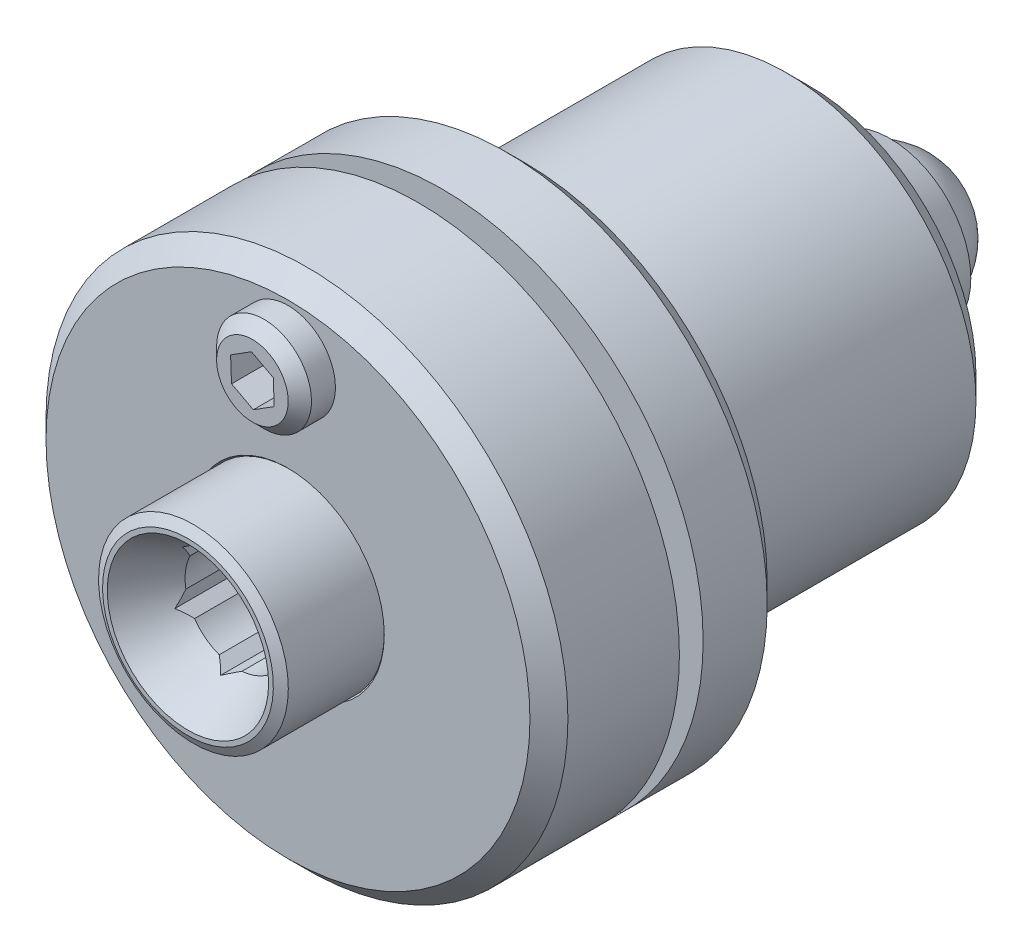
ISO-10303-21;
HEADER;
FILE_DESCRIPTION(('STEP AP214'),'2;1');
FILE_NAME('part.step','',(''),(''),'','','');
FILE_SCHEMA(('AUTOMOTIVE_DESIGN { 1 0 10303 214 1 1 1 1 }'));
ENDSEC;
DATA;
#1=APPLICATION_CONTEXT('core data for automotive mechanical design processes');
#2=APPLICATION_PROTOCOL_DEFINITION('international standard','automotive_design',2000,#1);
#3=PRODUCT_CONTEXT('',#1,'mechanical');
#4=PRODUCT('Part','Part','',(#3));
#5=PRODUCT_RELATED_PRODUCT_CATEGORY('part','',(#4));
#6=PRODUCT_DEFINITION_FORMATION('','',#4);
#7=PRODUCT_DEFINITION_CONTEXT('part definition',#1,'design');
#8=PRODUCT_DEFINITION('design','',#6,#7);
#9=PRODUCT_DEFINITION_SHAPE('','',#8);
#10=(LENGTH_UNIT() NAMED_UNIT(*) SI_UNIT(.MILLI.,.METRE.));
#11=(NAMED_UNIT(*) PLANE_ANGLE_UNIT() SI_UNIT($,.RADIAN.));
#12=(NAMED_UNIT(*) SI_UNIT($,.STERADIAN.) SOLID_ANGLE_UNIT());
#13=UNCERTAINTY_MEASURE_WITH_UNIT(LENGTH_MEASURE(1.E-05),#10,'distance_accuracy_value','');
#14=(GEOMETRIC_REPRESENTATION_CONTEXT(3) GLOBAL_UNCERTAINTY_ASSIGNED_CONTEXT((#13)) GLOBAL_UNIT_ASSIGNED_CONTEXT((#10,
#11,#12)) REPRESENTATION_CONTEXT('',''));
#15=CARTESIAN_POINT('',(0.,0.,0.));
#16=DIRECTION('',(0.,0.,1.));
#17=DIRECTION('',(1.,0.,0.));
#18=AXIS2_PLACEMENT_3D('',#15,#16,#17);
#19=CARTESIAN_POINT('',(0.,0.,-1.42346280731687));
#20=DIRECTION('',(0.181341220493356,0.487604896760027,0.854023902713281));
#21=DIRECTION('',(-0.295839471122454,-0.801147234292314,0.520232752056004));
#22=AXIS2_PLACEMENT_3D('',#19,#20,#21);
#23=SPHERICAL_SURFACE('',#22,1.5);
#24=CARTESIAN_POINT('',(-0.272011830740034,-0.73140734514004,-2.70449866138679));
#25=VERTEX_POINT('',#24);
#26=VERTEX_LOOP('',#25);
#27=FACE_BOUND('',#26,.T.);
#28=CARTESIAN_POINT('',(0.,1.47585065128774,-1.69153901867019));
#29=CARTESIAN_POINT('',(-0.0829018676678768,1.47584453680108,-1.69153901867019));
#30=CARTESIAN_POINT('',(-0.165897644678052,1.46883174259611,-1.69153901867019));
#31=CARTESIAN_POINT('',(-0.288543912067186,1.44796751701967,-1.69153901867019));
#32=CARTESIAN_POINT('',(-0.329152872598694,1.43927643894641,-1.69153901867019));
#33=CARTESIAN_POINT('',(-0.409534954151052,1.41849907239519,-1.69153901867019));
#34=CARTESIAN_POINT('',(-0.449307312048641,1.40640981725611,-1.69153901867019));
#35=CARTESIAN_POINT('',(-0.566773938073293,1.36520055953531,-1.69153901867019));
#36=CARTESIAN_POINT('',(-0.642782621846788,1.33111083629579,-1.69153901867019));
#37=CARTESIAN_POINT('',(-0.787990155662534,1.25063854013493,-1.69153901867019));
#38=CARTESIAN_POINT('',(-0.857188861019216,1.20425570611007,-1.69153901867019));
#39=CARTESIAN_POINT('',(-0.954378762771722,1.12651011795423,-1.69153901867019));
#40=CARTESIAN_POINT('',(-0.98569269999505,1.09921210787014,-1.69153901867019));
#41=CARTESIAN_POINT('',(-1.04588262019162,1.042105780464,-1.69153901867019));
#42=CARTESIAN_POINT('',(-1.07476091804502,1.01229990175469,-1.69153901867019));
#43=CARTESIAN_POINT('',(-1.15748734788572,0.9193612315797,-1.69153901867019));
#44=CARTESIAN_POINT('',(-1.20745051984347,0.852688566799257,-1.69153901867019));
#45=CARTESIAN_POINT('',(-1.29544663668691,0.711934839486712,-1.69153901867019));
#46=CARTESIAN_POINT('',(-1.33347955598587,0.637853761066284,-1.69153901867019));
#47=CARTESIAN_POINT('',(-1.39657387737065,0.484353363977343,-1.69153901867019));
#48=CARTESIAN_POINT('',(-1.42163597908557,0.404934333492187,-1.69153901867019));
#49=CARTESIAN_POINT('',(-1.45806687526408,0.243025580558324,-1.69153901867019));
#50=CARTESIAN_POINT('',(-1.46943719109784,0.160536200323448,-1.69153901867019));
#51=CARTESIAN_POINT('',(-1.47817377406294,-0.0051972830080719,-1.69153901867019));
#52=CARTESIAN_POINT('',(-1.47553617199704,-0.0884415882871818,-1.69153901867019));
#53=CARTESIAN_POINT('',(-1.45547711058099,-0.260489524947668,-1.69153901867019));
#54=CARTESIAN_POINT('',(-1.4367920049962,-0.349148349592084,-1.69153901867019));
#55=CARTESIAN_POINT('',(-1.38356099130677,-0.521569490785,-1.69153901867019));
#56=CARTESIAN_POINT('',(-1.34901506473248,-0.605331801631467,-1.69153901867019));
#57=CARTESIAN_POINT('',(-1.26859569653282,-0.758745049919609,-1.69153901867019));
#58=CARTESIAN_POINT('',(-1.22384759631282,-0.828988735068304,-1.69153901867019));
#59=CARTESIAN_POINT('',(-1.12320312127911,-0.9609535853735,-1.69153901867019));
#60=CARTESIAN_POINT('',(-1.06730985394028,-1.02267711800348,-1.69153901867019));
#61=CARTESIAN_POINT('',(-0.945949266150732,-1.13587061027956,-1.69153901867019));
#62=CARTESIAN_POINT('',(-0.880480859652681,-1.18733940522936,-1.69153901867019));
#63=CARTESIAN_POINT('',(-0.74182877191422,-1.27855841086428,-1.69153901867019));
#64=CARTESIAN_POINT('',(-0.668644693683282,-1.31830801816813,-1.69153901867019));
#65=CARTESIAN_POINT('',(-0.516643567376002,-1.38495525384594,-1.69153901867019));
#66=CARTESIAN_POINT('',(-0.437826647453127,-1.41185317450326,-1.69153901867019));
#67=CARTESIAN_POINT('',(-0.276796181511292,-1.45203488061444,-1.69153901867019));
#68=CARTESIAN_POINT('',(-0.194582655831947,-1.46531874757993,-1.69153901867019));
#69=CARTESIAN_POINT('',(-0.0290920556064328,-1.47789551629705,-1.69153901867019));
#70=CARTESIAN_POINT('',(0.0541850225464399,-1.47718837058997,-1.69153901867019));
#71=CARTESIAN_POINT('',(0.219438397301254,-1.46180308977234,-1.69153901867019));
#72=CARTESIAN_POINT('',(0.301414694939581,-1.44712496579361,-1.69153901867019));
#73=CARTESIAN_POINT('',(0.461739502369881,-1.40421441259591,-1.69153901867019));
#74=CARTESIAN_POINT('',(0.540088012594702,-1.37598198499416,-1.69153901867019));
#75=CARTESIAN_POINT('',(0.690933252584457,-1.30676422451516,-1.69153901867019));
#76=CARTESIAN_POINT('',(0.763429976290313,-1.26577887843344,-1.69153901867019));
#77=CARTESIAN_POINT('',(0.900513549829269,-1.17221876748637,-1.69153901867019));
#78=CARTESIAN_POINT('',(0.965100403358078,-1.11964400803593,-1.69153901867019));
#79=CARTESIAN_POINT('',(1.08453083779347,-1.00439750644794,-1.69153901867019));
#80=CARTESIAN_POINT('',(1.13937441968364,-0.941725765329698,-1.69153901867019));
#81=CARTESIAN_POINT('',(1.23776161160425,-0.808064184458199,-1.69153901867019));
#82=CARTESIAN_POINT('',(1.28130519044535,-0.737074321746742,-1.69153901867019));
#83=CARTESIAN_POINT('',(1.3558558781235,-0.58879221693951,-1.69153901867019));
#84=CARTESIAN_POINT('',(1.386863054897,-0.511500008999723,-1.69153901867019));
#85=CARTESIAN_POINT('',(1.43546077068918,-0.352808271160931,-1.69153901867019));
#86=CARTESIAN_POINT('',(1.45305151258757,-0.271408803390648,-1.69153901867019));
#87=CARTESIAN_POINT('',(1.47431796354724,-0.106808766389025,-1.69153901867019));
#88=CARTESIAN_POINT('',(1.47799317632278,-0.0236081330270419,-1.69153901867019));
#89=CARTESIAN_POINT('',(1.47132343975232,0.142233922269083,-1.69153901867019));
#90=CARTESIAN_POINT('',(1.46097751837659,0.224875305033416,-1.69153901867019));
#91=CARTESIAN_POINT('',(1.42655748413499,0.387237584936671,-1.69153901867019));
#92=CARTESIAN_POINT('',(1.40248576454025,0.466958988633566,-1.69153901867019));
#93=CARTESIAN_POINT('',(1.34299438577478,0.616969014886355,-1.69153901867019));
#94=CARTESIAN_POINT('',(1.3082723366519,0.687535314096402,-1.69153901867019));
#95=CARTESIAN_POINT('',(1.22807379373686,0.822262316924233,-1.69153901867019));
#96=CARTESIAN_POINT('',(1.1825977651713,0.886423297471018,-1.69153901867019));
#97=CARTESIAN_POINT('',(1.0791037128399,1.01022310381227,-1.69153901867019));
#98=CARTESIAN_POINT('',(1.02051010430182,1.06938194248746,-1.69153901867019));
#99=CARTESIAN_POINT('',(0.894196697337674,1.17704598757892,-1.69153901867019));
#100=CARTESIAN_POINT('',(0.826472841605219,1.22554643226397,-1.69153901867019));
#101=CARTESIAN_POINT('',(0.683818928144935,1.31050549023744,-1.69153901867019));
#102=CARTESIAN_POINT('',(0.608885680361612,1.34695874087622,-1.69153901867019));
#103=CARTESIAN_POINT('',(0.454029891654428,1.40672081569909,-1.69153901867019));
#104=CARTESIAN_POINT('',(0.37411414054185,1.43004711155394,-1.69153901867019));
#105=CARTESIAN_POINT('',(0.244696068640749,1.45625581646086,-1.69153901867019));
#106=CARTESIAN_POINT('',(0.19605386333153,1.46359492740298,-1.69153901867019));
#107=CARTESIAN_POINT('',(0.0982854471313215,1.47339416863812,-1.69153901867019));
#108=CARTESIAN_POINT('',(0.0491592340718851,1.47585427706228,-1.69153901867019));
#109=CARTESIAN_POINT('',(0.,1.47585065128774,-1.69153901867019));
#110=B_SPLINE_CURVE_WITH_KNOTS('',3,(#28,#29,#30,#31,#32,#33,#34,#35,#36,#37,#38,#39,#40,#41,
#42,#43,#44,#45,#46,#47,#48,#49,#50,#51,#52,#53,#54,#55,#56,#57,#58,#59,#60,#61,#62,#63,#64,#65,
#66,#67,#68,#69,#70,#71,#72,#73,#74,#75,#76,#77,#78,#79,#80,#81,#82,#83,#84,#85,#86,#87,#88,#89,
#90,#91,#92,#93,#94,#95,#96,#97,#98,#99,#100,#101,#102,#103,#104,#105,#106,#107,#108,#109),
.UNSPECIFIED.,.T.,.F.,(4,2,2,2,2,2,2,2,2,2,2,2,2,2,2,2,2,2,2,2,2,2,2,2,2,2,2,2,2,2,2,2,2,2,2,2,
2,2,2,2,4),(0.,0.248496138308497,0.372962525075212,0.497537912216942,0.746193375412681,
0.994854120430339,1.11935055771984,1.24372730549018,1.4923915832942,1.74105639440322,
1.98970779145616,2.23833155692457,2.48702399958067,2.75730780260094,3.02759192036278,
3.27628464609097,3.52490812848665,3.77355983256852,4.02222433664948,4.27088318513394,
4.51954054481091,4.76819874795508,5.01685675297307,5.26551472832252,5.51417296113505,
5.7628310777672,6.01148916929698,6.26014794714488,6.50880537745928,6.75745904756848,
7.00612158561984,7.25480136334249,7.5034377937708,7.73838756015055,7.97332716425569,
8.22192984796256,8.47064337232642,8.71946745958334,8.96795957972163,9.11531241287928,
9.2626659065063),.UNSPECIFIED.);
#111=CARTESIAN_POINT('',(0.,1.47585065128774,-1.69153901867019));
#112=VERTEX_POINT('',#111);
#113=EDGE_CURVE('E213',#112,#112,#110,.T.);
#114=ORIENTED_EDGE('',*,*,#113,.F.);
#115=EDGE_LOOP('',(#114));
#116=FACE_BOUND('',#115,.T.);
#117=ADVANCED_FACE('F16',(#27,#116),#23,.T.);
#118=CARTESIAN_POINT('',(1.12080950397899,0.462370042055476,13.1084609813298));
#119=DIRECTION('',(0.609900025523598,0.792478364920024,0.));
#120=DIRECTION('',(-0.792478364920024,0.609900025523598,0.));
#121=AXIS2_PLACEMENT_3D('',#118,#119,#120);
#122=PLANE('',#121);
#123=DIRECTION('',(0.,0.,1.));
#124=VECTOR('',#123,1.);
#125=CARTESIAN_POINT('',(0.159980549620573,1.20183452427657,13.1084609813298));
#126=LINE('',#125,#124);
#127=CARTESIAN_POINT('',(0.159980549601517,1.20183452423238,12.2639746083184));
#128=VERTEX_POINT('',#127);
#129=CARTESIAN_POINT('',(0.159980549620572,1.20183452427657,8.10846098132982));
#130=VERTEX_POINT('',#129);
#131=EDGE_CURVE('E175',#128,#130,#126,.F.);
#132=ORIENTED_EDGE('',*,*,#131,.T.);
#133=DIRECTION('',(-0.792478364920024,0.609900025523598,0.));
#134=VECTOR('',#133,1.);
#135=CARTESIAN_POINT('',(0.380563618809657,1.03207137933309,8.10846098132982));
#136=LINE('',#135,#134);
#137=CARTESIAN_POINT('',(0.380563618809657,1.03207137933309,8.10846098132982));
#138=VERTEX_POINT('',#137);
#139=EDGE_CURVE('E254',#138,#130,#136,.T.);
#140=ORIENTED_EDGE('',*,*,#139,.F.);
#141=DIRECTION('',(0.,0.,1.));
#142=VECTOR('',#141,1.);
#143=CARTESIAN_POINT('',(0.380563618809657,1.03207137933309,10.1084609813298));
#144=LINE('',#143,#142);
#145=CARTESIAN_POINT('',(0.380563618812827,1.03207137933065,12.0692304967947));
#146=VERTEX_POINT('',#145);
#147=EDGE_CURVE('E253',#138,#146,#144,.T.);
#148=ORIENTED_EDGE('',*,*,#147,.T.);
#149=CARTESIAN_POINT('',(0.159980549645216,1.20183452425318,12.2639746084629));
#150=CARTESIAN_POINT('',(0.177001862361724,1.18873473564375,12.2453856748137));
#151=CARTESIAN_POINT('',(0.194311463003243,1.17541307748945,12.2271992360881));
#152=CARTESIAN_POINT('',(0.229536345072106,1.14830362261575,12.1919501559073));
#153=CARTESIAN_POINT('',(0.24744935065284,1.13451757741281,12.1748838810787));
#154=CARTESIAN_POINT('',(0.284037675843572,1.10635880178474,12.1420522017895));
#155=CARTESIAN_POINT('',(0.30271349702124,1.09198568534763,12.1262876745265));
#156=CARTESIAN_POINT('',(0.340959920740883,1.06255081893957,12.0964053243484));
#157=CARTESIAN_POINT('',(0.360533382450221,1.04748686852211,12.0822933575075));
#158=CARTESIAN_POINT('',(0.380563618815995,1.03207137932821,12.0692304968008));
#159=B_SPLINE_CURVE_WITH_KNOTS('',3,(#149,#150,#151,#152,#153,#154,#155,#156,#157,#158),
.UNSPECIFIED.,.F.,.F.,(4,2,2,2,4),(0.,0.0852281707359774,0.170164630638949,0.255157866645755,
0.340443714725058),.UNSPECIFIED.);
#160=EDGE_CURVE('E20',#128,#146,#159,.T.);
#161=ORIENTED_EDGE('',*,*,#160,.F.);
#162=EDGE_LOOP('',(#132,#140,#148,#161));
#163=FACE_BOUND('',#162,.T.);
#164=ADVANCED_FACE('F764',(#163),#122,.F.);
#165=CARTESIAN_POINT('',(1.12080950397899,0.462370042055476,13.1084609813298));
#166=DIRECTION('',(0.609900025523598,0.792478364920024,0.));
#167=DIRECTION('',(-0.792478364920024,0.609900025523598,0.));
#168=AXIS2_PLACEMENT_3D('',#165,#166,#167);
#169=PLANE('',#168);
#170=DIRECTION('',(0.,0.,1.));
#171=VECTOR('',#170,1.);
#172=CARTESIAN_POINT('',(0.900226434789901,0.632133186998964,10.1084609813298));
#173=LINE('',#172,#171);
#174=CARTESIAN_POINT('',(0.900226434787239,0.632133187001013,12.069230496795));
#175=VERTEX_POINT('',#174);
#176=CARTESIAN_POINT('',(0.900226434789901,0.632133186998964,8.10846098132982));
#177=VERTEX_POINT('',#176);
#178=EDGE_CURVE('E443',#175,#177,#173,.F.);
#179=ORIENTED_EDGE('',*,*,#178,.T.);
#180=DIRECTION('',(-0.792478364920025,0.609900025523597,0.));
#181=VECTOR('',#180,1.);
#182=CARTESIAN_POINT('',(1.12080950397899,0.462370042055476,8.10846098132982));
#183=LINE('',#182,#181);
#184=CARTESIAN_POINT('',(1.12080950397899,0.462370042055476,8.10846098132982));
#185=VERTEX_POINT('',#184);
#186=EDGE_CURVE('E440',#185,#177,#183,.T.);
#187=ORIENTED_EDGE('',*,*,#186,.F.);
#188=DIRECTION('',(0.,0.,1.));
#189=VECTOR('',#188,1.);
#190=CARTESIAN_POINT('',(1.12080950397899,0.462370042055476,13.1084609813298));
#191=LINE('',#190,#189);
#192=CARTESIAN_POINT('',(1.12080950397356,0.462370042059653,12.2639746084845));
#193=VERTEX_POINT('',#192);
#194=EDGE_CURVE('E439',#185,#193,#191,.T.);
#195=ORIENTED_EDGE('',*,*,#194,.T.);
#196=CARTESIAN_POINT('',(0.900226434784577,0.632133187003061,12.0692304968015));
#197=CARTESIAN_POINT('',(0.920256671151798,0.616717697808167,12.0822933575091));
#198=CARTESIAN_POINT('',(0.939830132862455,0.601653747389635,12.0964053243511));
#199=CARTESIAN_POINT('',(0.978076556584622,0.572218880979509,12.1262876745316));
#200=CARTESIAN_POINT('',(0.996752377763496,0.557845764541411,12.1420522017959));
#201=CARTESIAN_POINT('',(1.03334070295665,0.529686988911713,12.1748838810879));
#202=CARTESIAN_POINT('',(1.05125370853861,0.515900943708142,12.1919501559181));
#203=CARTESIAN_POINT('',(1.08647859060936,0.488791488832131,12.2271992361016));
#204=CARTESIAN_POINT('',(1.10378819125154,0.475469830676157,12.2453856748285));
#205=CARTESIAN_POINT('',(1.12080950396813,0.462370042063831,12.2639746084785));
#206=B_SPLINE_CURVE_WITH_KNOTS('',3,(#196,#197,#198,#199,#200,#201,#202,#203,#204,#205),
.UNSPECIFIED.,.F.,.F.,(4,2,2,2,4),(0.,0.0852858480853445,0.170279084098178,0.255215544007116,
0.340443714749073),.UNSPECIFIED.);
#207=EDGE_CURVE('E782',#175,#193,#206,.T.);
#208=ORIENTED_EDGE('',*,*,#207,.F.);
#209=EDGE_LOOP('',(#179,#187,#195,#208));
#210=FACE_BOUND('',#209,.T.);
#211=ADVANCED_FACE('F759',(#210),#169,.F.);
#212=CARTESIAN_POINT('',(0.,0.,8.10846098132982));
#213=DIRECTION('',(0.,0.,1.));
#214=DIRECTION('',(0.,-1.,0.));
#215=AXIS2_PLACEMENT_3D('',#212,#213,#214);
#216=PLANE('',#215);
#217=DIRECTION('',(0.131949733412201,0.991256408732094,0.));
#218=VECTOR('',#217,1.);
#219=CARTESIAN_POINT('',(0.960828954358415,-0.739464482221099,8.10846098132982));
#220=LINE('',#219,#218);
#221=CARTESIAN_POINT('',(1.08408184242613,0.186457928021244,8.10846098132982));
#222=VERTEX_POINT('',#221);
#223=EDGE_CURVE('E436',#222,#185,#220,.T.);
#224=ORIENTED_EDGE('',*,*,#223,.T.);
#225=ORIENTED_EDGE('',*,*,#186,.T.);
#226=CARTESIAN_POINT('',(0.,0.,8.10846098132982));
#227=DIRECTION('',(0.,0.,1.));
#228=DIRECTION('',(1.,0.,0.));
#229=AXIS2_PLACEMENT_3D('',#226,#227,#228);
#230=CIRCLE('',#229,1.1);
#231=EDGE_CURVE('E435',#177,#222,#230,.F.);
#232=ORIENTED_EDGE('',*,*,#231,.T.);
#233=EDGE_LOOP('',(#224,#225,#232));
#234=FACE_BOUND('',#233,.T.);
#235=ADVANCED_FACE('F754',(#234),#216,.T.);
#236=CARTESIAN_POINT('',(0.960828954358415,-0.739464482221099,13.1084609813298));
#237=DIRECTION('',(0.991256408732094,-0.131949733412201,0.));
#238=DIRECTION('',(0.131949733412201,0.991256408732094,0.));
#239=AXIS2_PLACEMENT_3D('',#236,#237,#238);
#240=PLANE('',#239);
#241=ORIENTED_EDGE('',*,*,#194,.F.);
#242=ORIENTED_EDGE('',*,*,#223,.F.);
#243=DIRECTION('',(0.,0.,1.));
#244=VECTOR('',#243,1.);
#245=CARTESIAN_POINT('',(1.08408184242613,0.186457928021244,10.1084609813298));
#246=LINE('',#245,#244);
#247=CARTESIAN_POINT('',(1.08408184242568,0.186457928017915,12.069230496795));
#248=VERTEX_POINT('',#247);
#249=EDGE_CURVE('E432',#222,#248,#246,.T.);
#250=ORIENTED_EDGE('',*,*,#249,.T.);
#251=CARTESIAN_POINT('',(1.12080950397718,0.462370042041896,12.2639746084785));
#252=CARTESIAN_POINT('',(1.11797541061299,0.441079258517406,12.2453856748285));
#253=CARTESIAN_POINT('',(1.11509331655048,0.419427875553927,12.2271992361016));
#254=CARTESIAN_POINT('',(1.10922828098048,0.375367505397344,12.1919501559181));
#255=CARTESIAN_POINT('',(1.10624571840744,0.352961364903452,12.1748838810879));
#256=CARTESIAN_POINT('',(1.10015366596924,0.307195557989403,12.1420522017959));
#257=CARTESIAN_POINT('',(1.09704409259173,0.283835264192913,12.1262876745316));
#258=CARTESIAN_POINT('',(1.09067596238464,0.23599545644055,12.0964053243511));
#259=CARTESIAN_POINT('',(1.08741692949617,0.211512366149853,12.0822933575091));
#260=CARTESIAN_POINT('',(1.08408184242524,0.186457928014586,12.0692304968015));
#261=B_SPLINE_CURVE_WITH_KNOTS('',3,(#251,#252,#253,#254,#255,#256,#257,#258,#259,#260),
.UNSPECIFIED.,.F.,.F.,(4,2,2,2,4),(0.,0.0852281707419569,0.170164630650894,0.255157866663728,
0.340443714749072),.UNSPECIFIED.);
#262=EDGE_CURVE('E787',#193,#248,#261,.T.);
#263=ORIENTED_EDGE('',*,*,#262,.F.);
#264=EDGE_LOOP('',(#241,#242,#250,#263));
#265=FACE_BOUND('',#264,.T.);
#266=ADVANCED_FACE('F750',(#265),#240,.F.);
#267=CARTESIAN_POINT('',(0.960828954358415,-0.739464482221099,13.1084609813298));
#268=DIRECTION('',(0.991256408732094,-0.131949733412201,0.));
#269=DIRECTION('',(0.131949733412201,0.991256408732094,0.));
#270=AXIS2_PLACEMENT_3D('',#267,#268,#269);
#271=PLANE('',#270);
#272=DIRECTION('',(0.,0.,1.));
#273=VECTOR('',#272,1.);
#274=CARTESIAN_POINT('',(0.997556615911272,-0.463552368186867,10.1084609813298));
#275=LINE('',#274,#273);
#276=CARTESIAN_POINT('',(0.997556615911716,-0.463552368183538,12.069230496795));
#277=VERTEX_POINT('',#276);
#278=CARTESIAN_POINT('',(0.997556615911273,-0.463552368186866,8.10846098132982));
#279=VERTEX_POINT('',#278);
#280=EDGE_CURVE('E197',#277,#279,#275,.F.);
#281=ORIENTED_EDGE('',*,*,#280,.T.);
#282=DIRECTION('',(0.131949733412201,0.991256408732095,0.));
#283=VECTOR('',#282,1.);
#284=CARTESIAN_POINT('',(0.960828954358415,-0.739464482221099,8.10846098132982));
#285=LINE('',#284,#283);
#286=CARTESIAN_POINT('',(0.960828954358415,-0.739464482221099,8.10846098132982));
#287=VERTEX_POINT('',#286);
#288=EDGE_CURVE('E189',#287,#279,#285,.T.);
#289=ORIENTED_EDGE('',*,*,#288,.F.);
#290=DIRECTION('',(0.,0.,1.));
#291=VECTOR('',#290,1.);
#292=CARTESIAN_POINT('',(0.960828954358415,-0.739464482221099,13.1084609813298));
#293=LINE('',#292,#291);
#294=CARTESIAN_POINT('',(0.960828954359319,-0.739464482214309,12.2639746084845));
#295=VERTEX_POINT('',#294);
#296=EDGE_CURVE('E194',#287,#295,#293,.T.);
#297=ORIENTED_EDGE('',*,*,#296,.T.);
#298=CARTESIAN_POINT('',(0.997556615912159,-0.463552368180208,12.0692304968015));
#299=CARTESIAN_POINT('',(0.994221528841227,-0.488606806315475,12.0822933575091));
#300=CARTESIAN_POINT('',(0.990962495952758,-0.513089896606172,12.0964053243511));
#301=CARTESIAN_POINT('',(0.984594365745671,-0.560929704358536,12.1262876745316));
#302=CARTESIAN_POINT('',(0.981484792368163,-0.584289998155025,12.1420522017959));
#303=CARTESIAN_POINT('',(0.975392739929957,-0.630055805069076,12.1748838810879));
#304=CARTESIAN_POINT('',(0.972410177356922,-0.652461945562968,12.1919501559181));
#305=CARTESIAN_POINT('',(0.966545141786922,-0.696522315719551,12.2271992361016));
#306=CARTESIAN_POINT('',(0.963663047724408,-0.71817369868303,12.2453856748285));
#307=CARTESIAN_POINT('',(0.960828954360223,-0.739464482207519,12.2639746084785));
#308=B_SPLINE_CURVE_WITH_KNOTS('',3,(#298,#299,#300,#301,#302,#303,#304,#305,#306,#307),
.UNSPECIFIED.,.F.,.F.,(4,2,2,2,4),(0.,0.085285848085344,0.17027908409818,0.255215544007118,
0.340443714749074),.UNSPECIFIED.);
#309=EDGE_CURVE('E201',#277,#295,#308,.T.);
#310=ORIENTED_EDGE('',*,*,#309,.F.);
#311=EDGE_LOOP('',(#281,#289,#297,#310));
#312=FACE_BOUND('',#311,.T.);
#313=ADVANCED_FACE('F191',(#312),#271,.F.);
#314=CARTESIAN_POINT('',(0.,0.,8.10846098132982));
#315=DIRECTION('',(0.,0.,1.));
#316=DIRECTION('',(0.,-1.,0.));
#317=AXIS2_PLACEMENT_3D('',#314,#315,#316);
#318=PLANE('',#317);
#319=DIRECTION('',(0.924428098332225,0.381356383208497,0.));
#320=VECTOR('',#319,1.);
#321=CARTESIAN_POINT('',(-0.15998054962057,-1.20183452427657,8.10846098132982));
#322=LINE('',#321,#320);
#323=CARTESIAN_POINT('',(0.703518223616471,-0.845613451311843,8.10846098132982));
#324=VERTEX_POINT('',#323);
#325=EDGE_CURVE('E200',#324,#287,#322,.T.);
#326=ORIENTED_EDGE('',*,*,#325,.T.);
#327=ORIENTED_EDGE('',*,*,#288,.T.);
#328=CARTESIAN_POINT('',(0.,0.,8.10846098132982));
#329=DIRECTION('',(0.,0.,1.));
#330=DIRECTION('',(1.,0.,0.));
#331=AXIS2_PLACEMENT_3D('',#328,#329,#330);
#332=CIRCLE('',#331,1.1);
#333=EDGE_CURVE('E205',#279,#324,#332,.F.);
#334=ORIENTED_EDGE('',*,*,#333,.T.);
#335=EDGE_LOOP('',(#326,#327,#334));
#336=FACE_BOUND('',#335,.T.);
#337=ADVANCED_FACE('F204',(#336),#318,.T.);
#338=CARTESIAN_POINT('',(-0.15998054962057,-1.20183452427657,13.1084609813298));
#339=DIRECTION('',(0.381356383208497,-0.924428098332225,0.));
#340=DIRECTION('',(0.924428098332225,0.381356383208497,0.));
#341=AXIS2_PLACEMENT_3D('',#338,#339,#340);
#342=PLANE('',#341);
#343=ORIENTED_EDGE('',*,*,#296,.F.);
#344=ORIENTED_EDGE('',*,*,#325,.F.);
#345=DIRECTION('',(0.,0.,1.));
#346=VECTOR('',#345,1.);
#347=CARTESIAN_POINT('',(0.703518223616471,-0.845613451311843,10.1084609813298));
#348=LINE('',#347,#346);
#349=CARTESIAN_POINT('',(0.703518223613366,-0.845613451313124,12.069230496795));
#350=VERTEX_POINT('',#349);
#351=EDGE_CURVE('E397',#324,#350,#348,.T.);
#352=ORIENTED_EDGE('',*,*,#351,.T.);
#353=CARTESIAN_POINT('',(0.96082895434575,-0.739464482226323,12.2639746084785));
#354=CARTESIAN_POINT('',(0.940973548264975,-0.747655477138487,12.2453856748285));
#355=CARTESIAN_POINT('',(0.920781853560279,-0.755985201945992,12.2271992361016));
#356=CARTESIAN_POINT('',(0.879691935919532,-0.772936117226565,12.1919501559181));
#357=CARTESIAN_POINT('',(0.858796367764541,-0.781556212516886,12.1748838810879));
#358=CARTESIAN_POINT('',(0.816115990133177,-0.799163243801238,12.1420522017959));
#359=CARTESIAN_POINT('',(0.794330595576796,-0.808150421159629,12.1262876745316));
#360=CARTESIAN_POINT('',(0.749716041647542,-0.826555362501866,12.0964053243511));
#361=CARTESIAN_POINT('',(0.726883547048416,-0.835974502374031,12.0822933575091));
#362=CARTESIAN_POINT('',(0.703518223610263,-0.845613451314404,12.0692304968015));
#363=B_SPLINE_CURVE_WITH_KNOTS('',3,(#353,#354,#355,#356,#357,#358,#359,#360,#361,#362),
.UNSPECIFIED.,.F.,.F.,(4,2,2,2,4),(0.,0.0852281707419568,0.170164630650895,0.255157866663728,
0.340443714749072),.UNSPECIFIED.);
#364=EDGE_CURVE('E211',#295,#350,#363,.T.);
#365=ORIENTED_EDGE('',*,*,#364,.F.);
#366=EDGE_LOOP('',(#343,#344,#352,#365));
#367=FACE_BOUND('',#366,.T.);
#368=ADVANCED_FACE('F210',(#367),#342,.F.);
#369=CARTESIAN_POINT('',(-0.991256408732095,0.131949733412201,-1.69153901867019));
#370=DIRECTION('',(0.,0.,-1.));
#371=DIRECTION('',(-1.,0.,0.));
#372=AXIS2_PLACEMENT_3D('',#369,#370,#371);
#373=PLANE('',#372);
#374=ORIENTED_EDGE('',*,*,#113,.T.);
#375=EDGE_LOOP('',(#374));
#376=FACE_BOUND('',#375,.T.);
#377=CARTESIAN_POINT('',(0.,0.,-1.69153901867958));
#378=DIRECTION('',(0.,0.,1.));
#379=DIRECTION('',(1.,0.,0.));
#380=AXIS2_PLACEMENT_3D('',#377,#378,#379);
#381=CIRCLE('',#380,1.69989690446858);
#382=CARTESIAN_POINT('',(1.69989690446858,0.,-1.69153901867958));
#383=VERTEX_POINT('',#382);
#384=EDGE_CURVE('E396',#383,#383,#381,.T.);
#385=ORIENTED_EDGE('',*,*,#384,.F.);
#386=EDGE_LOOP('',(#385));
#387=FACE_BOUND('',#386,.T.);
#388=ADVANCED_FACE('F735',(#376,#387),#373,.T.);
#389=CARTESIAN_POINT('',(0.,0.,7.10846098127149));
#390=DIRECTION('',(0.,0.,1.));
#391=DIRECTION('',(1.,0.,0.));
#392=AXIS2_PLACEMENT_3D('',#389,#390,#391);
#393=CONICAL_SURFACE('',#392,1.09999999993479,1.04719755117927);
#394=CARTESIAN_POINT('',(0.,0.,6.47337568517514));
#395=VERTEX_POINT('',#394);
#396=VERTEX_LOOP('',#395);
#397=FACE_BOUND('',#396,.T.);
#398=CARTESIAN_POINT('',(0.,0.,7.10846098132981));
#399=DIRECTION('',(0.,0.,1.));
#400=DIRECTION('',(1.,0.,0.));
#401=AXIS2_PLACEMENT_3D('',#398,#399,#400);
#402=CIRCLE('',#401,1.1);
#403=CARTESIAN_POINT('',(1.1,0.,7.10846098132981));
#404=VERTEX_POINT('',#403);
#405=EDGE_CURVE('E391',#404,#404,#402,.T.);
#406=ORIENTED_EDGE('',*,*,#405,.T.);
#407=EDGE_LOOP('',(#406));
#408=FACE_BOUND('',#407,.T.);
#409=ADVANCED_FACE('F730',(#397,#408),#393,.F.);
#410=CARTESIAN_POINT('',(-1.12080950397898,-0.462370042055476,13.1084609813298));
#411=DIRECTION('',(-0.609900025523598,-0.792478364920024,0.));
#412=DIRECTION('',(0.792478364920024,-0.609900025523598,0.));
#413=AXIS2_PLACEMENT_3D('',#410,#411,#412);
#414=PLANE('',#413);
#415=DIRECTION('',(0.,0.,1.));
#416=VECTOR('',#415,1.);
#417=CARTESIAN_POINT('',(-0.900226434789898,-0.632133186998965,10.1084609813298));
#418=LINE('',#417,#416);
#419=CARTESIAN_POINT('',(-0.900226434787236,-0.632133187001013,12.069230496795));
#420=VERTEX_POINT('',#419);
#421=CARTESIAN_POINT('',(-0.900226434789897,-0.632133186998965,8.10846098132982));
#422=VERTEX_POINT('',#421);
#423=EDGE_CURVE('E390',#420,#422,#418,.F.);
#424=ORIENTED_EDGE('',*,*,#423,.T.);
#425=DIRECTION('',(0.792478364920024,-0.609900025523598,0.));
#426=VECTOR('',#425,1.);
#427=CARTESIAN_POINT('',(-1.12080950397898,-0.462370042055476,8.10846098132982));
#428=LINE('',#427,#426);
#429=CARTESIAN_POINT('',(-1.12080950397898,-0.462370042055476,8.10846098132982));
#430=VERTEX_POINT('',#429);
#431=EDGE_CURVE('E220',#430,#422,#428,.T.);
#432=ORIENTED_EDGE('',*,*,#431,.F.);
#433=DIRECTION('',(0.,0.,1.));
#434=VECTOR('',#433,1.);
#435=CARTESIAN_POINT('',(-1.12080950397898,-0.462370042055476,13.1084609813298));
#436=LINE('',#435,#434);
#437=CARTESIAN_POINT('',(-1.12080950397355,-0.462370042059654,12.2639746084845));
#438=VERTEX_POINT('',#437);
#439=EDGE_CURVE('E227',#430,#438,#436,.T.);
#440=ORIENTED_EDGE('',*,*,#439,.T.);
#441=CARTESIAN_POINT('',(-0.900226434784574,-0.632133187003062,12.0692304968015));
#442=CARTESIAN_POINT('',(-0.920256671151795,-0.616717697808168,12.0822933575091));
#443=CARTESIAN_POINT('',(-0.939830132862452,-0.601653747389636,12.0964053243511));
#444=CARTESIAN_POINT('',(-0.978076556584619,-0.572218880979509,12.1262876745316));
#445=CARTESIAN_POINT('',(-0.996752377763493,-0.557845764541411,12.1420522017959));
#446=CARTESIAN_POINT('',(-1.03334070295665,-0.529686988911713,12.1748838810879));
#447=CARTESIAN_POINT('',(-1.05125370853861,-0.515900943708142,12.1919501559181));
#448=CARTESIAN_POINT('',(-1.08647859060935,-0.488791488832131,12.2271992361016));
#449=CARTESIAN_POINT('',(-1.10378819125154,-0.475469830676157,12.2453856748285));
#450=CARTESIAN_POINT('',(-1.12080950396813,-0.462370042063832,12.2639746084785));
#451=B_SPLINE_CURVE_WITH_KNOTS('',3,(#441,#442,#443,#444,#445,#446,#447,#448,#449,#450),
.UNSPECIFIED.,.F.,.F.,(4,2,2,2,4),(0.,0.0852858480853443,0.17027908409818,0.255215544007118,
0.340443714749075),.UNSPECIFIED.);
#452=EDGE_CURVE('E224',#420,#438,#451,.T.);
#453=ORIENTED_EDGE('',*,*,#452,.F.);
#454=EDGE_LOOP('',(#424,#432,#440,#453));
#455=FACE_BOUND('',#454,.T.);
#456=ADVANCED_FACE('F725',(#455),#414,.F.);
#457=CARTESIAN_POINT('',(0.,0.,8.10846098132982));
#458=DIRECTION('',(0.,0.,1.));
#459=DIRECTION('',(0.,-1.,0.));
#460=AXIS2_PLACEMENT_3D('',#457,#458,#459);
#461=PLANE('',#460);
#462=DIRECTION('',(-0.131949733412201,-0.991256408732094,0.));
#463=VECTOR('',#462,1.);
#464=CARTESIAN_POINT('',(-0.960828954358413,0.739464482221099,8.10846098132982));
#465=LINE('',#464,#463);
#466=CARTESIAN_POINT('',(-1.08408184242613,-0.186457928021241,8.10846098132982));
#467=VERTEX_POINT('',#466);
#468=EDGE_CURVE('E223',#467,#430,#465,.T.);
#469=ORIENTED_EDGE('',*,*,#468,.T.);
#470=ORIENTED_EDGE('',*,*,#431,.T.);
#471=CARTESIAN_POINT('',(0.,0.,8.10846098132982));
#472=DIRECTION('',(0.,0.,1.));
#473=DIRECTION('',(1.,0.,0.));
#474=AXIS2_PLACEMENT_3D('',#471,#472,#473);
#475=CIRCLE('',#474,1.1);
#476=EDGE_CURVE('E418',#422,#467,#475,.F.);
#477=ORIENTED_EDGE('',*,*,#476,.T.);
#478=EDGE_LOOP('',(#469,#470,#477));
#479=FACE_BOUND('',#478,.T.);
#480=ADVANCED_FACE('F720',(#479),#461,.T.);
#481=CARTESIAN_POINT('',(-0.960828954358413,0.739464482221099,13.1084609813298));
#482=DIRECTION('',(-0.991256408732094,0.131949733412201,0.));
#483=DIRECTION('',(-0.131949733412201,-0.991256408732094,0.));
#484=AXIS2_PLACEMENT_3D('',#481,#482,#483);
#485=PLANE('',#484);
#486=ORIENTED_EDGE('',*,*,#439,.F.);
#487=ORIENTED_EDGE('',*,*,#468,.F.);
#488=DIRECTION('',(0.,0.,1.));
#489=VECTOR('',#488,1.);
#490=CARTESIAN_POINT('',(-1.08408184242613,-0.186457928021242,10.1084609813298));
#491=LINE('',#490,#489);
#492=CARTESIAN_POINT('',(-1.08408184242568,-0.186457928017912,12.069230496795));
#493=VERTEX_POINT('',#492);
#494=EDGE_CURVE('E415',#467,#493,#491,.T.);
#495=ORIENTED_EDGE('',*,*,#494,.T.);
#496=CARTESIAN_POINT('',(-1.12080950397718,-0.462370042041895,12.2639746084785));
#497=CARTESIAN_POINT('',(-1.11797541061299,-0.441079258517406,12.2453856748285));
#498=CARTESIAN_POINT('',(-1.11509331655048,-0.419427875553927,12.2271992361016));
#499=CARTESIAN_POINT('',(-1.10922828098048,-0.375367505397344,12.1919501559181));
#500=CARTESIAN_POINT('',(-1.10624571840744,-0.352961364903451,12.1748838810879));
#501=CARTESIAN_POINT('',(-1.10015366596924,-0.307195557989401,12.1420522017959));
#502=CARTESIAN_POINT('',(-1.09704409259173,-0.283835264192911,12.1262876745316));
#503=CARTESIAN_POINT('',(-1.09067596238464,-0.235995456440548,12.0964053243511));
#504=CARTESIAN_POINT('',(-1.08741692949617,-0.211512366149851,12.0822933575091));
#505=CARTESIAN_POINT('',(-1.08408184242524,-0.186457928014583,12.0692304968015));
#506=B_SPLINE_CURVE_WITH_KNOTS('',3,(#496,#497,#498,#499,#500,#501,#502,#503,#504,#505),
.UNSPECIFIED.,.F.,.F.,(4,2,2,2,4),(0.,0.0852281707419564,0.170164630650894,0.25515786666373,
0.340443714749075),.UNSPECIFIED.);
#507=EDGE_CURVE('E230',#438,#493,#506,.T.);
#508=ORIENTED_EDGE('',*,*,#507,.F.);
#509=EDGE_LOOP('',(#486,#487,#495,#508));
#510=FACE_BOUND('',#509,.T.);
#511=ADVANCED_FACE('F715',(#510),#485,.F.);
#512=CARTESIAN_POINT('',(-0.960828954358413,0.739464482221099,13.1084609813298));
#513=DIRECTION('',(-0.991256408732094,0.131949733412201,0.));
#514=DIRECTION('',(-0.131949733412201,-0.991256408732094,0.));
#515=AXIS2_PLACEMENT_3D('',#512,#513,#514);
#516=PLANE('',#515);
#517=DIRECTION('',(0.,0.,1.));
#518=VECTOR('',#517,1.);
#519=CARTESIAN_POINT('',(-0.997556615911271,0.463552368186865,10.1084609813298));
#520=LINE('',#519,#518);
#521=CARTESIAN_POINT('',(-0.997556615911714,0.463552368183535,12.069230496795));
#522=VERTEX_POINT('',#521);
#523=CARTESIAN_POINT('',(-0.997556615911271,0.463552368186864,8.10846098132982));
#524=VERTEX_POINT('',#523);
#525=EDGE_CURVE('E411',#522,#524,#520,.F.);
#526=ORIENTED_EDGE('',*,*,#525,.T.);
#527=DIRECTION('',(-0.131949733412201,-0.991256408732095,0.));
#528=VECTOR('',#527,1.);
#529=CARTESIAN_POINT('',(-0.960828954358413,0.739464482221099,8.10846098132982));
#530=LINE('',#529,#528);
#531=CARTESIAN_POINT('',(-0.960828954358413,0.739464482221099,8.10846098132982));
#532=VERTEX_POINT('',#531);
#533=EDGE_CURVE('E233',#532,#524,#530,.T.);
#534=ORIENTED_EDGE('',*,*,#533,.F.);
#535=DIRECTION('',(0.,0.,1.));
#536=VECTOR('',#535,1.);
#537=CARTESIAN_POINT('',(-0.960828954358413,0.739464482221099,13.1084609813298));
#538=LINE('',#537,#536);
#539=CARTESIAN_POINT('',(-0.960828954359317,0.739464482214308,12.2639746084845));
#540=VERTEX_POINT('',#539);
#541=EDGE_CURVE('E240',#532,#540,#538,.T.);
#542=ORIENTED_EDGE('',*,*,#541,.T.);
#543=CARTESIAN_POINT('',(-0.997556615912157,0.463552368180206,12.0692304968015));
#544=CARTESIAN_POINT('',(-0.994221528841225,0.488606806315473,12.0822933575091));
#545=CARTESIAN_POINT('',(-0.990962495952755,0.51308989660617,12.0964053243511));
#546=CARTESIAN_POINT('',(-0.984594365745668,0.560929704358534,12.1262876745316));
#547=CARTESIAN_POINT('',(-0.98148479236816,0.584289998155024,12.1420522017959));
#548=CARTESIAN_POINT('',(-0.975392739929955,0.630055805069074,12.1748838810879));
#549=CARTESIAN_POINT('',(-0.97241017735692,0.652461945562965,12.1919501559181));
#550=CARTESIAN_POINT('',(-0.96654514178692,0.696522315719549,12.2271992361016));
#551=CARTESIAN_POINT('',(-0.963663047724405,0.718173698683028,12.2453856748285));
#552=CARTESIAN_POINT('',(-0.96082895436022,0.739464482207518,12.2639746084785));
#553=B_SPLINE_CURVE_WITH_KNOTS('',3,(#543,#544,#545,#546,#547,#548,#549,#550,#551,#552),
.UNSPECIFIED.,.F.,.F.,(4,2,2,2,4),(0.,0.0852858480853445,0.170279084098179,0.255215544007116,
0.340443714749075),.UNSPECIFIED.);
#554=EDGE_CURVE('E237',#522,#540,#553,.T.);
#555=ORIENTED_EDGE('',*,*,#554,.F.);
#556=EDGE_LOOP('',(#526,#534,#542,#555));
#557=FACE_BOUND('',#556,.T.);
#558=ADVANCED_FACE('F710',(#557),#516,.F.);
#559=CARTESIAN_POINT('',(0.,0.,8.10846098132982));
#560=DIRECTION('',(0.,0.,1.));
#561=DIRECTION('',(0.,-1.,0.));
#562=AXIS2_PLACEMENT_3D('',#559,#560,#561);
#563=PLANE('',#562);
#564=DIRECTION('',(-0.924428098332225,-0.381356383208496,0.));
#565=VECTOR('',#564,1.);
#566=CARTESIAN_POINT('',(0.159980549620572,1.20183452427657,8.10846098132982));
#567=LINE('',#566,#565);
#568=CARTESIAN_POINT('',(-0.703518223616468,0.845613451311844,8.10846098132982));
#569=VERTEX_POINT('',#568);
#570=EDGE_CURVE('E236',#569,#532,#567,.T.);
#571=ORIENTED_EDGE('',*,*,#570,.T.);
#572=ORIENTED_EDGE('',*,*,#533,.T.);
#573=CARTESIAN_POINT('',(0.,0.,8.10846098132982));
#574=DIRECTION('',(0.,0.,1.));
#575=DIRECTION('',(1.,0.,0.));
#576=AXIS2_PLACEMENT_3D('',#573,#574,#575);
#577=CIRCLE('',#576,1.1);
#578=EDGE_CURVE('E406',#524,#569,#577,.F.);
#579=ORIENTED_EDGE('',*,*,#578,.T.);
#580=EDGE_LOOP('',(#571,#572,#579));
#581=FACE_BOUND('',#580,.T.);
#582=ADVANCED_FACE('F705',(#581),#563,.T.);
#583=CARTESIAN_POINT('',(0.159980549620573,1.20183452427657,13.1084609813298));
#584=DIRECTION('',(-0.381356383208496,0.924428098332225,0.));
#585=DIRECTION('',(-0.924428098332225,-0.381356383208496,0.));
#586=AXIS2_PLACEMENT_3D('',#583,#584,#585);
#587=PLANE('',#586);
#588=ORIENTED_EDGE('',*,*,#541,.F.);
#589=ORIENTED_EDGE('',*,*,#570,.F.);
#590=DIRECTION('',(0.,0.,1.));
#591=VECTOR('',#590,1.);
#592=CARTESIAN_POINT('',(-0.703518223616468,0.845613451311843,10.1084609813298));
#593=LINE('',#592,#591);
#594=CARTESIAN_POINT('',(-0.703518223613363,0.845613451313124,12.069230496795));
#595=VERTEX_POINT('',#594);
#596=EDGE_CURVE('E403',#569,#595,#593,.T.);
#597=ORIENTED_EDGE('',*,*,#596,.T.);
#598=CARTESIAN_POINT('',(-0.960828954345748,0.739464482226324,12.2639746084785));
#599=CARTESIAN_POINT('',(-0.940973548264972,0.747655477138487,12.2453856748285));
#600=CARTESIAN_POINT('',(-0.920781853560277,0.755985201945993,12.2271992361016));
#601=CARTESIAN_POINT('',(-0.879691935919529,0.772936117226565,12.1919501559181));
#602=CARTESIAN_POINT('',(-0.858796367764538,0.781556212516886,12.1748838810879));
#603=CARTESIAN_POINT('',(-0.816115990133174,0.799163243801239,12.1420522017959));
#604=CARTESIAN_POINT('',(-0.794330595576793,0.80815042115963,12.1262876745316));
#605=CARTESIAN_POINT('',(-0.749716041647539,0.826555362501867,12.0964053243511));
#606=CARTESIAN_POINT('',(-0.726883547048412,0.835974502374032,12.0822933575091));
#607=CARTESIAN_POINT('',(-0.703518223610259,0.845613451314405,12.0692304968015));
#608=B_SPLINE_CURVE_WITH_KNOTS('',3,(#598,#599,#600,#601,#602,#603,#604,#605,#606,#607),
.UNSPECIFIED.,.F.,.F.,(4,2,2,2,4),(0.,0.0852281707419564,0.170164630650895,0.25515786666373,
0.340443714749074),.UNSPECIFIED.);
#609=EDGE_CURVE('E243',#540,#595,#608,.T.);
#610=ORIENTED_EDGE('',*,*,#609,.F.);
#611=EDGE_LOOP('',(#588,#589,#597,#610));
#612=FACE_BOUND('',#611,.T.);
#613=ADVANCED_FACE('F700',(#612),#587,.F.);
#614=CARTESIAN_POINT('',(0.159980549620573,1.20183452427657,13.1084609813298));
#615=DIRECTION('',(-0.381356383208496,0.924428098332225,0.));
#616=DIRECTION('',(-0.924428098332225,-0.381356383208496,0.));
#617=AXIS2_PLACEMENT_3D('',#614,#615,#616);
#618=PLANE('',#617);
#619=DIRECTION('',(0.,0.,1.));
#620=VECTOR('',#619,1.);
#621=CARTESIAN_POINT('',(-0.0973301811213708,1.09568555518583,10.1084609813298));
#622=LINE('',#621,#620);
#623=CARTESIAN_POINT('',(-0.0973301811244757,1.09568555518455,12.069230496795));
#624=VERTEX_POINT('',#623);
#625=CARTESIAN_POINT('',(-0.0973301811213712,1.09568555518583,8.10846098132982));
#626=VERTEX_POINT('',#625);
#627=EDGE_CURVE('E398',#624,#626,#622,.F.);
#628=ORIENTED_EDGE('',*,*,#627,.T.);
#629=DIRECTION('',(-0.924428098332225,-0.381356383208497,0.));
#630=VECTOR('',#629,1.);
#631=CARTESIAN_POINT('',(0.159980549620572,1.20183452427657,8.10846098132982));
#632=LINE('',#631,#630);
#633=EDGE_CURVE('E250',#130,#626,#632,.T.);
#634=ORIENTED_EDGE('',*,*,#633,.F.);
#635=ORIENTED_EDGE('',*,*,#131,.F.);
#636=CARTESIAN_POINT('',(-0.0973301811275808,1.09568555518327,12.0692304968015));
#637=CARTESIAN_POINT('',(-0.0739648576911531,1.10532450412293,12.0822933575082));
#638=CARTESIAN_POINT('',(-0.0511323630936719,1.11474364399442,12.0964053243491));
#639=CARTESIAN_POINT('',(-0.00651780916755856,1.13314858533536,12.1262876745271));
#640=CARTESIAN_POINT('',(0.0152675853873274,1.14213576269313,12.1420522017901));
#641=CARTESIAN_POINT('',(0.0579479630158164,1.1597427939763,12.1748838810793));
#642=CARTESIAN_POINT('',(0.0788435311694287,1.16836288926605,12.1919501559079));
#643=CARTESIAN_POINT('',(0.119933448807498,1.18531380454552,12.2271992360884));
#644=CARTESIAN_POINT('',(0.140125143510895,1.19364352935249,12.2453856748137));
#645=CARTESIAN_POINT('',(0.159980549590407,1.20183452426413,12.2639746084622));
#646=B_SPLINE_CURVE_WITH_KNOTS('',3,(#636,#637,#638,#639,#640,#641,#642,#643,#644,#645),
.UNSPECIFIED.,.F.,.F.,(4,2,2,2,4),(0.,0.0852858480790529,0.170279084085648,0.255215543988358,
0.340443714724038),.UNSPECIFIED.);
#647=EDGE_CURVE('E247',#624,#128,#646,.T.);
#648=ORIENTED_EDGE('',*,*,#647,.F.);
#649=EDGE_LOOP('',(#628,#634,#635,#648));
#650=FACE_BOUND('',#649,.T.);
#651=ADVANCED_FACE('F695',(#650),#618,.F.);
#652=CARTESIAN_POINT('',(0.,0.,8.10846098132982));
#653=DIRECTION('',(0.,0.,1.));
#654=DIRECTION('',(0.,-1.,0.));
#655=AXIS2_PLACEMENT_3D('',#652,#653,#654);
#656=PLANE('',#655);
#657=ORIENTED_EDGE('',*,*,#633,.T.);
#658=CARTESIAN_POINT('',(0.,0.,8.10846098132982));
#659=DIRECTION('',(0.,0.,1.));
#660=DIRECTION('',(1.,0.,0.));
#661=AXIS2_PLACEMENT_3D('',#658,#659,#660);
#662=CIRCLE('',#661,1.1);
#663=EDGE_CURVE('E400',#626,#138,#662,.F.);
#664=ORIENTED_EDGE('',*,*,#663,.T.);
#665=ORIENTED_EDGE('',*,*,#139,.T.);
#666=EDGE_LOOP('',(#657,#664,#665));
#667=FACE_BOUND('',#666,.T.);
#668=ADVANCED_FACE('F690',(#667),#656,.T.);
#669=CARTESIAN_POINT('',(0.,0.,-0.571539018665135));
#670=DIRECTION('',(0.,0.,1.));
#671=DIRECTION('',(1.,0.,0.));
#672=AXIS2_PLACEMENT_3D('',#669,#670,#671);
#673=CONICAL_SURFACE('',#672,2.00000000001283,0.261799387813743);
#674=CARTESIAN_POINT('',(0.,0.,-0.571539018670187));
#675=DIRECTION('',(0.,0.,1.));
#676=DIRECTION('',(1.,0.,0.));
#677=AXIS2_PLACEMENT_3D('',#674,#675,#676);
#678=CIRCLE('',#677,2.);
#679=CARTESIAN_POINT('',(2.,0.,-0.571539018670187));
#680=VERTEX_POINT('',#679);
#681=EDGE_CURVE('E276',#680,#680,#678,.T.);
#682=ORIENTED_EDGE('',*,*,#681,.F.);
#683=EDGE_LOOP('',(#682));
#684=FACE_BOUND('',#683,.T.);
#685=ORIENTED_EDGE('',*,*,#384,.T.);
#686=EDGE_LOOP('',(#685));
#687=FACE_BOUND('',#686,.T.);
#688=ADVANCED_FACE('F685',(#684,#687),#673,.T.);
#689=CARTESIAN_POINT('',(0.,0.,10.1084609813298));
#690=DIRECTION('',(0.,0.,1.));
#691=DIRECTION('',(1.,0.,0.));
#692=AXIS2_PLACEMENT_3D('',#689,#690,#691);
#693=CYLINDRICAL_SURFACE('',#692,1.1);
#694=DIRECTION('',(0.,0.,1.));
#695=VECTOR('',#694,1.);
#696=CARTESIAN_POINT('',(-0.380563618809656,-1.03207137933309,13.1084609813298));
#697=LINE('',#696,#695);
#698=CARTESIAN_POINT('',(-0.380563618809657,-1.03207137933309,12.0692304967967));
#699=VERTEX_POINT('',#698);
#700=CARTESIAN_POINT('',(-0.380563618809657,-1.03207137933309,8.10846098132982));
#701=VERTEX_POINT('',#700);
#702=EDGE_CURVE('E273',#699,#701,#697,.F.);
#703=ORIENTED_EDGE('',*,*,#702,.T.);
#704=CARTESIAN_POINT('',(0.,0.,8.10846098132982));
#705=DIRECTION('',(0.,0.,1.));
#706=DIRECTION('',(1.,0.,0.));
#707=AXIS2_PLACEMENT_3D('',#704,#705,#706);
#708=CIRCLE('',#707,1.1);
#709=CARTESIAN_POINT('',(0.0973301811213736,-1.09568555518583,8.10846098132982));
#710=VERTEX_POINT('',#709);
#711=EDGE_CURVE('E381',#710,#701,#708,.F.);
#712=ORIENTED_EDGE('',*,*,#711,.F.);
#713=DIRECTION('',(0.,0.,1.));
#714=VECTOR('',#713,1.);
#715=CARTESIAN_POINT('',(0.0973301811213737,-1.09568555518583,13.1084609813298));
#716=LINE('',#715,#714);
#717=CARTESIAN_POINT('',(0.0973301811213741,-1.09568555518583,12.0692304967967));
#718=VERTEX_POINT('',#717);
#719=EDGE_CURVE('E261',#710,#718,#716,.T.);
#720=ORIENTED_EDGE('',*,*,#719,.T.);
#721=CARTESIAN_POINT('',(0.,0.,12.0692304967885));
#722=DIRECTION('',(0.,0.,1.));
#723=DIRECTION('',(1.,0.,0.));
#724=AXIS2_PLACEMENT_3D('',#721,#722,#723);
#725=CIRCLE('',#724,1.1);
#726=EDGE_CURVE('E394',#350,#718,#725,.F.);
#727=ORIENTED_EDGE('',*,*,#726,.F.);
#728=ORIENTED_EDGE('',*,*,#351,.F.);
#729=ORIENTED_EDGE('',*,*,#333,.F.);
#730=ORIENTED_EDGE('',*,*,#280,.F.);
#731=CARTESIAN_POINT('',(0.,0.,12.0692304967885));
#732=DIRECTION('',(0.,0.,1.));
#733=DIRECTION('',(1.,0.,0.));
#734=AXIS2_PLACEMENT_3D('',#731,#732,#733);
#735=CIRCLE('',#734,1.1);
#736=EDGE_CURVE('E430',#248,#277,#735,.F.);
#737=ORIENTED_EDGE('',*,*,#736,.F.);
#738=ORIENTED_EDGE('',*,*,#249,.F.);
#739=ORIENTED_EDGE('',*,*,#231,.F.);
#740=ORIENTED_EDGE('',*,*,#178,.F.);
#741=CARTESIAN_POINT('',(0.,0.,12.0692304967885));
#742=DIRECTION('',(0.,0.,1.));
#743=DIRECTION('',(1.,0.,0.));
#744=AXIS2_PLACEMENT_3D('',#741,#742,#743);
#745=CIRCLE('',#744,1.1);
#746=EDGE_CURVE('E445',#146,#175,#745,.F.);
#747=ORIENTED_EDGE('',*,*,#746,.F.);
#748=ORIENTED_EDGE('',*,*,#147,.F.);
#749=ORIENTED_EDGE('',*,*,#663,.F.);
#750=ORIENTED_EDGE('',*,*,#627,.F.);
#751=CARTESIAN_POINT('',(0.,0.,12.0692304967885));
#752=DIRECTION('',(0.,0.,1.));
#753=DIRECTION('',(1.,0.,0.));
#754=AXIS2_PLACEMENT_3D('',#751,#752,#753);
#755=CIRCLE('',#754,1.1);
#756=EDGE_CURVE('E401',#595,#624,#755,.F.);
#757=ORIENTED_EDGE('',*,*,#756,.F.);
#758=ORIENTED_EDGE('',*,*,#596,.F.);
#759=ORIENTED_EDGE('',*,*,#578,.F.);
#760=ORIENTED_EDGE('',*,*,#525,.F.);
#761=CARTESIAN_POINT('',(0.,0.,12.0692304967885));
#762=DIRECTION('',(0.,0.,1.));
#763=DIRECTION('',(1.,0.,0.));
#764=AXIS2_PLACEMENT_3D('',#761,#762,#763);
#765=CIRCLE('',#764,1.1);
#766=EDGE_CURVE('E413',#493,#522,#765,.F.);
#767=ORIENTED_EDGE('',*,*,#766,.F.);
#768=ORIENTED_EDGE('',*,*,#494,.F.);
#769=ORIENTED_EDGE('',*,*,#476,.F.);
#770=ORIENTED_EDGE('',*,*,#423,.F.);
#771=CARTESIAN_POINT('',(0.,0.,12.0692304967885));
#772=DIRECTION('',(0.,0.,1.));
#773=DIRECTION('',(1.,0.,0.));
#774=AXIS2_PLACEMENT_3D('',#771,#772,#773);
#775=CIRCLE('',#774,1.1);
#776=EDGE_CURVE('E388',#699,#420,#775,.F.);
#777=ORIENTED_EDGE('',*,*,#776,.F.);
#778=EDGE_LOOP('',(#703,#712,#720,#727,#728,#729,#730,#737,#738,#739,#740,#747,#748,#749,#750,
#757,#758,#759,#760,#767,#768,#769,#770,#777));
#779=FACE_BOUND('',#778,.T.);
#780=ORIENTED_EDGE('',*,*,#405,.F.);
#781=EDGE_LOOP('',(#780));
#782=FACE_BOUND('',#781,.T.);
#783=ADVANCED_FACE('F680',(#779,#782),#693,.F.);
#784=CARTESIAN_POINT('',(0.,0.,8.10846098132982));
#785=DIRECTION('',(0.,0.,1.));
#786=DIRECTION('',(0.,-1.,0.));
#787=AXIS2_PLACEMENT_3D('',#784,#785,#786);
#788=PLANE('',#787);
#789=DIRECTION('',(0.924428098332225,0.381356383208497,0.));
#790=VECTOR('',#789,1.);
#791=CARTESIAN_POINT('',(-0.15998054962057,-1.20183452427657,8.10846098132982));
#792=LINE('',#791,#790);
#793=CARTESIAN_POINT('',(-0.159980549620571,-1.20183452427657,8.10846098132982));
#794=VERTEX_POINT('',#793);
#795=EDGE_CURVE('E265',#794,#710,#792,.T.);
#796=ORIENTED_EDGE('',*,*,#795,.T.);
#797=ORIENTED_EDGE('',*,*,#711,.T.);
#798=DIRECTION('',(0.792478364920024,-0.609900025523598,0.));
#799=VECTOR('',#798,1.);
#800=CARTESIAN_POINT('',(-1.12080950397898,-0.462370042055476,8.10846098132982));
#801=LINE('',#800,#799);
#802=EDGE_CURVE('E270',#701,#794,#801,.T.);
#803=ORIENTED_EDGE('',*,*,#802,.T.);
#804=EDGE_LOOP('',(#796,#797,#803));
#805=FACE_BOUND('',#804,.T.);
#806=ADVANCED_FACE('F675',(#805),#788,.T.);
#807=CARTESIAN_POINT('',(-0.15998054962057,-1.20183452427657,13.1084609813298));
#808=DIRECTION('',(0.381356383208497,-0.924428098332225,0.));
#809=DIRECTION('',(0.924428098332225,0.381356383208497,0.));
#810=AXIS2_PLACEMENT_3D('',#807,#808,#809);
#811=PLANE('',#810);
#812=ORIENTED_EDGE('',*,*,#719,.F.);
#813=ORIENTED_EDGE('',*,*,#795,.F.);
#814=DIRECTION('',(0.,0.,1.));
#815=VECTOR('',#814,1.);
#816=CARTESIAN_POINT('',(-0.15998054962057,-1.20183452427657,13.1084609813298));
#817=LINE('',#816,#815);
#818=CARTESIAN_POINT('',(-0.159980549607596,-1.2018345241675,12.2639746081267));
#819=VERTEX_POINT('',#818);
#820=EDGE_CURVE('E266',#794,#819,#817,.T.);
#821=ORIENTED_EDGE('',*,*,#820,.T.);
#822=CARTESIAN_POINT('',(0.0973301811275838,-1.09568555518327,12.0692304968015));
#823=CARTESIAN_POINT('',(0.0739648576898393,-1.10532450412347,12.0822933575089));
#824=CARTESIAN_POINT('',(0.0511323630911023,-1.11474364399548,12.0964053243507));
#825=CARTESIAN_POINT('',(0.00651780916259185,-1.13314858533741,12.1262876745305));
#826=CARTESIAN_POINT('',(-0.0152675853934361,-1.14213576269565,12.1420522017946));
#827=CARTESIAN_POINT('',(-0.0579479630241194,-1.15974279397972,12.1748838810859));
#828=CARTESIAN_POINT('',(-0.0788435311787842,-1.16836288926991,12.1919501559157));
#829=CARTESIAN_POINT('',(-0.119933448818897,-1.18531380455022,12.2271992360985));
#830=CARTESIAN_POINT('',(-0.140125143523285,-1.1936435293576,12.245385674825));
#831=CARTESIAN_POINT('',(-0.159980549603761,-1.20183452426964,12.2639746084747));
#832=B_SPLINE_CURVE_WITH_KNOTS('',3,(#822,#823,#824,#825,#826,#827,#828,#829,#830,#831),
.UNSPECIFIED.,.F.,.F.,(4,2,2,2,4),(0.,0.0852858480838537,0.170279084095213,0.255215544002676,
0.340443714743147),.UNSPECIFIED.);
#833=EDGE_CURVE('E264',#718,#819,#832,.T.);
#834=ORIENTED_EDGE('',*,*,#833,.F.);
#835=EDGE_LOOP('',(#812,#813,#821,#834));
#836=FACE_BOUND('',#835,.T.);
#837=ADVANCED_FACE('F670',(#836),#811,.F.);
#838=CARTESIAN_POINT('',(-0.0197157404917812,4.51924107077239,11.75));
#839=DIRECTION('',(-0.532499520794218,0.846430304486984,0.));
#840=DIRECTION('',(-0.846430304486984,-0.532499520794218,0.));
#841=AXIS2_PLACEMENT_3D('',#838,#839,#840);
#842=PLANE('',#841);
#843=DIRECTION('',(0.,0.,1.));
#844=VECTOR('',#843,1.);
#845=CARTESIAN_POINT('',(-0.0197157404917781,4.51924107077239,11.75));
#846=LINE('',#845,#844);
#847=CARTESIAN_POINT('',(-0.0197157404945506,4.51924107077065,10.0500000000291));
#848=VERTEX_POINT('',#847);
#849=CARTESIAN_POINT('',(-0.0197157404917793,4.51924107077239,11.75));
#850=VERTEX_POINT('',#849);
#851=EDGE_CURVE('E269',#848,#850,#846,.T.);
#852=ORIENTED_EDGE('',*,*,#851,.T.);
#853=DIRECTION('',(-0.846430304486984,-0.532499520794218,0.));
#854=VECTOR('',#853,1.);
#855=CARTESIAN_POINT('',(-0.0197157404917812,4.51924107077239,11.75));
#856=LINE('',#855,#854);
#857=CARTESIAN_POINT('',(-0.459533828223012,4.24254620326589,11.75));
#858=VERTEX_POINT('',#857);
#859=EDGE_CURVE('E373',#858,#850,#856,.F.);
#860=ORIENTED_EDGE('',*,*,#859,.F.);
#861=DIRECTION('',(0.,0.,1.));
#862=VECTOR('',#861,1.);
#863=CARTESIAN_POINT('',(-0.459533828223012,4.24254620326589,11.75));
#864=LINE('',#863,#862);
#865=CARTESIAN_POINT('',(-0.459533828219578,4.24254620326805,10.0500000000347));
#866=VERTEX_POINT('',#865);
#867=EDGE_CURVE('E282',#858,#866,#864,.F.);
#868=ORIENTED_EDGE('',*,*,#867,.T.);
#869=CARTESIAN_POINT('',(-0.0197157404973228,4.5192410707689,10.0500000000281));
#870=CARTESIAN_POINT('',(-0.0390434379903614,4.50708178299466,10.0434070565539));
#871=CARTESIAN_POINT('',(-0.0585374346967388,4.4948178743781,10.0374103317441));
#872=CARTESIAN_POINT('',(-0.0978629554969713,4.47007771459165,10.0269431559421));
#873=CARTESIAN_POINT('',(-0.117695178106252,4.45760102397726,10.0224764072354));
#874=CARTESIAN_POINT('',(-0.157114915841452,4.43280159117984,10.0155251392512));
#875=CARTESIAN_POINT('',(-0.176696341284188,4.42048268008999,10.012994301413));
#876=CARTESIAN_POINT('',(-0.215947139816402,4.39578952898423,10.0099681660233));
#877=CARTESIAN_POINT('',(-0.235616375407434,4.38341537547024,10.0094703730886));
#878=CARTESIAN_POINT('',(-0.28948394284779,4.34952663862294,10.0109951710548));
#879=CARTESIAN_POINT('',(-0.323651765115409,4.32803124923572,10.0151579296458));
#880=CARTESIAN_POINT('',(-0.374654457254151,4.29594484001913,10.0254137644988));
#881=CARTESIAN_POINT('',(-0.391805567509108,4.28515486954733,10.0295714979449));
#882=CARTESIAN_POINT('',(-0.425852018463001,4.2637358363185,10.0390071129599));
#883=CARTESIAN_POINT('',(-0.442747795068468,4.25310649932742,10.0442827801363));
#884=CARTESIAN_POINT('',(-0.459533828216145,4.24254620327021,10.0500000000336));
#885=B_SPLINE_CURVE_WITH_KNOTS('',3,(#869,#870,#871,#872,#873,#874,#875,#876,#877,#878,#879,
#880,#881,#882,#883,#884),.UNSPECIFIED.,.F.,.F.,(4,2,2,2,2,2,2,4),(0.,0.0713286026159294,
0.142828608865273,0.212559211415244,0.282204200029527,0.403439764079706,0.465471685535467,
0.527381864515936),.UNSPECIFIED.);
#886=EDGE_CURVE('E376',#848,#866,#885,.T.);
#887=ORIENTED_EDGE('',*,*,#886,.F.);
#888=EDGE_LOOP('',(#852,#860,#868,#887));
#889=FACE_BOUND('',#888,.T.);
#890=ADVANCED_FACE('F665',(#889),#842,.F.);
#891=CARTESIAN_POINT('',(0.,0.,5.70846098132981));
#892=DIRECTION('',(0.,0.,1.));
#893=DIRECTION('',(1.,0.,0.));
#894=AXIS2_PLACEMENT_3D('',#891,#892,#893);
#895=CYLINDRICAL_SURFACE('',#894,2.);
#896=ORIENTED_EDGE('',*,*,#681,.T.);
#897=EDGE_LOOP('',(#896));
#898=FACE_BOUND('',#897,.T.);
#899=CARTESIAN_POINT('',(0.,0.,0.0294999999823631));
#900=DIRECTION('',(0.,0.,-1.));
#901=DIRECTION('',(1.,0.,0.));
#902=AXIS2_PLACEMENT_3D('',#899,#900,#901);
#903=CIRCLE('',#902,1.99999999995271);
#904=CARTESIAN_POINT('',(1.99999999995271,0.,0.0294999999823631));
#905=VERTEX_POINT('',#904);
#906=EDGE_CURVE('E369',#905,#905,#903,.F.);
#907=ORIENTED_EDGE('',*,*,#906,.F.);
#908=EDGE_LOOP('',(#907));
#909=FACE_BOUND('',#908,.T.);
#910=ADVANCED_FACE('F660',(#898,#909),#895,.T.);
#911=CARTESIAN_POINT('',(-1.12080950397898,-0.462370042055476,13.1084609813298));
#912=DIRECTION('',(-0.609900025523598,-0.792478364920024,0.));
#913=DIRECTION('',(0.792478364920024,-0.609900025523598,0.));
#914=AXIS2_PLACEMENT_3D('',#911,#912,#913);
#915=PLANE('',#914);
#916=ORIENTED_EDGE('',*,*,#820,.F.);
#917=ORIENTED_EDGE('',*,*,#802,.F.);
#918=ORIENTED_EDGE('',*,*,#702,.F.);
#919=CARTESIAN_POINT('',(-0.380563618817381,-1.03207137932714,12.0692304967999));
#920=CARTESIAN_POINT('',(-0.360533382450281,-1.04748686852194,12.0822933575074));
#921=CARTESIAN_POINT('',(-0.340959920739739,-1.06255081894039,12.0964053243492));
#922=CARTESIAN_POINT('',(-0.302713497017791,-1.09198568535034,12.1262876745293));
#923=CARTESIAN_POINT('',(-0.284037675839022,-1.10635880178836,12.1420522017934));
#924=CARTESIAN_POINT('',(-0.247449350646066,-1.1345175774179,12.174883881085));
#925=CARTESIAN_POINT('',(-0.229536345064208,-1.1483036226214,12.1919501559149));
#926=CARTESIAN_POINT('',(-0.194311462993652,-1.17541307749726,12.227199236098));
#927=CARTESIAN_POINT('',(-0.177001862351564,-1.18873473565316,12.2453856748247));
#928=CARTESIAN_POINT('',(-0.159980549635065,-1.20183452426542,12.2639746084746));
#929=B_SPLINE_CURVE_WITH_KNOTS('',3,(#919,#920,#921,#922,#923,#924,#925,#926,#927,#928),
.UNSPECIFIED.,.F.,.F.,(4,2,2,2,4),(0.,0.0852858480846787,0.170279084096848,0.255215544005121,
0.340443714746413),.UNSPECIFIED.);
#930=EDGE_CURVE('E293',#699,#819,#929,.T.);
#931=ORIENTED_EDGE('',*,*,#930,.T.);
#932=EDGE_LOOP('',(#916,#917,#918,#931));
#933=FACE_BOUND('',#932,.T.);
#934=ADVANCED_FACE('F655',(#933),#915,.F.);
#935=CARTESIAN_POINT('',(0.43981808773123,4.2766948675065,11.75));
#936=DIRECTION('',(0.466780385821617,0.884373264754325,0.));
#937=DIRECTION('',(-0.884373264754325,0.466780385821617,0.));
#938=AXIS2_PLACEMENT_3D('',#935,#936,#937);
#939=PLANE('',#938);
#940=DIRECTION('',(0.,0.,1.));
#941=VECTOR('',#940,1.);
#942=CARTESIAN_POINT('',(0.43981808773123,4.2766948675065,11.75));
#943=LINE('',#942,#941);
#944=CARTESIAN_POINT('',(0.439817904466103,4.2766947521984,10.0499998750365));
#945=VERTEX_POINT('',#944);
#946=CARTESIAN_POINT('',(0.43981808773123,4.2766948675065,11.75));
#947=VERTEX_POINT('',#946);
#948=EDGE_CURVE('E289',#945,#947,#943,.T.);
#949=ORIENTED_EDGE('',*,*,#948,.T.);
#950=DIRECTION('',(-0.884373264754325,0.466780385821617,0.));
#951=VECTOR('',#950,1.);
#952=CARTESIAN_POINT('',(0.43981808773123,4.2766948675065,11.75));
#953=LINE('',#952,#951);
#954=EDGE_CURVE('E279',#850,#947,#953,.F.);
#955=ORIENTED_EDGE('',*,*,#954,.F.);
#956=ORIENTED_EDGE('',*,*,#851,.F.);
#957=CARTESIAN_POINT('',(0.439817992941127,4.27669486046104,10.0500000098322));
#958=CARTESIAN_POINT('',(0.419623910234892,4.28735352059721,10.0434070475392));
#959=CARTESIAN_POINT('',(0.399256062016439,4.29810387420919,10.0374103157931));
#960=CARTESIAN_POINT('',(0.358167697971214,4.3197907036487,10.0269431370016));
#961=CARTESIAN_POINT('',(0.337446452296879,4.33072756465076,10.0224763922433));
#962=CARTESIAN_POINT('',(0.296259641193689,4.35246634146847,10.0155251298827));
#963=CARTESIAN_POINT('',(0.275800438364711,4.36326489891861,10.0129942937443));
#964=CARTESIAN_POINT('',(0.234790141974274,4.38491051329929,10.0099681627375));
#965=CARTESIAN_POINT('',(0.214239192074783,4.3957574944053,10.0094703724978));
#966=CARTESIAN_POINT('',(0.15795691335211,4.42546380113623,10.0109951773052));
#967=CARTESIAN_POINT('',(0.122257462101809,4.44430630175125,10.0151579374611));
#968=CARTESIAN_POINT('',(0.068968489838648,4.47243271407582,10.0254137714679));
#969=CARTESIAN_POINT('',(0.0510485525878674,4.4818910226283,10.029571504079));
#970=CARTESIAN_POINT('',(0.0154759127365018,4.50066659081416,10.039007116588));
#971=CARTESIAN_POINT('',(-0.00217724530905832,4.50998409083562,10.0442827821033));
#972=CARTESIAN_POINT('',(-0.01971574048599,4.51924107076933,10.0500000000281));
#973=B_SPLINE_CURVE_WITH_KNOTS('',3,(#957,#958,#959,#960,#961,#962,#963,#964,#965,#966,#967,
#968,#969,#970,#971,#972),.UNSPECIFIED.,.F.,.F.,(4,2,2,2,2,2,2,4),(0.,0.0713286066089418,
0.142828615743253,0.21255921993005,0.282204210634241,0.403439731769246,0.465471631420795,
0.527381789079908),.UNSPECIFIED.);
#974=EDGE_CURVE('E285',#945,#848,#973,.T.);
#975=ORIENTED_EDGE('',*,*,#974,.F.);
#976=EDGE_LOOP('',(#949,#955,#956,#975));
#977=FACE_BOUND('',#976,.T.);
#978=ADVANCED_FACE('F650',(#977),#939,.F.);
#979=CARTESIAN_POINT('',(-0.459533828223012,4.24254620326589,11.75));
#980=DIRECTION('',(-0.999279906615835,-0.0379429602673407,0.));
#981=DIRECTION('',(0.0379429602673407,-0.999279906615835,0.));
#982=AXIS2_PLACEMENT_3D('',#979,#980,#981);
#983=PLANE('',#982);
#984=ORIENTED_EDGE('',*,*,#867,.F.);
#985=DIRECTION('',(0.0379429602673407,-0.999279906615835,0.));
#986=VECTOR('',#985,1.);
#987=CARTESIAN_POINT('',(-0.459533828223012,4.24254620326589,11.75));
#988=LINE('',#987,#986);
#989=CARTESIAN_POINT('',(-0.439818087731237,3.72330513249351,11.75));
#990=VERTEX_POINT('',#989);
#991=EDGE_CURVE('E286',#990,#858,#988,.F.);
#992=ORIENTED_EDGE('',*,*,#991,.F.);
#993=DIRECTION('',(0.,0.,1.));
#994=VECTOR('',#993,1.);
#995=CARTESIAN_POINT('',(-0.439818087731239,3.72330513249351,11.75));
#996=LINE('',#995,#994);
#997=CARTESIAN_POINT('',(-0.439818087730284,3.72330513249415,10.0500000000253));
#998=VERTEX_POINT('',#997);
#999=EDGE_CURVE('E296',#990,#998,#996,.F.);
#1000=ORIENTED_EDGE('',*,*,#999,.T.);
#1001=CARTESIAN_POINT('',(-0.459533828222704,4.24254620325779,10.0500000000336));
#1002=CARTESIAN_POINT('',(-0.458667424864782,4.21972828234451,10.0434070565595));
#1003=CARTESIAN_POINT('',(-0.457793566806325,4.19671403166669,10.03741033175));
#1004=CARTESIAN_POINT('',(-0.456030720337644,4.15028705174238,10.0269431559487));
#1005=CARTESIAN_POINT('',(-0.455141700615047,4.12687349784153,10.0224764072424));
#1006=CARTESIAN_POINT('',(-0.453374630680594,4.0803352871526,10.015525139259));
#1007=CARTESIAN_POINT('',(-0.452496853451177,4.05721781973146,10.0129943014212));
#1008=CARTESIAN_POINT('',(-0.450737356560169,4.0108790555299,10.0099681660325));
#1009=CARTESIAN_POINT('',(-0.449855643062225,3.98765792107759,10.0094703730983));
#1010=CARTESIAN_POINT('',(-0.447440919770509,3.92406287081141,10.0109951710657));
#1011=CARTESIAN_POINT('',(-0.445909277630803,3.88372497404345,10.0151579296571));
#1012=CARTESIAN_POINT('',(-0.44362297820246,3.8235121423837,10.0254137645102));
#1013=CARTESIAN_POINT('',(-0.442854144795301,3.80326385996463,10.0295714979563));
#1014=CARTESIAN_POINT('',(-0.441327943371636,3.76306925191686,10.039007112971));
#1015=CARTESIAN_POINT('',(-0.440570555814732,3.74312241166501,10.0442827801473));
#1016=CARTESIAN_POINT('',(-0.439818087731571,3.72330513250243,10.0500000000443));
#1017=B_SPLINE_CURVE_WITH_KNOTS('',3,(#1001,#1002,#1003,#1004,#1005,#1006,#1007,#1008,#1009,
#1010,#1011,#1012,#1013,#1014,#1015,#1016),.UNSPECIFIED.,.F.,.F.,(4,2,2,2,2,2,2,4),(0.,
0.0713286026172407,0.142828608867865,0.21255921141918,0.282204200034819,0.403439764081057,
0.465471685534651,0.527381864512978),.UNSPECIFIED.);
#1018=EDGE_CURVE('E372',#866,#998,#1017,.T.);
#1019=ORIENTED_EDGE('',*,*,#1018,.F.);
#1020=EDGE_LOOP('',(#984,#992,#1000,#1019));
#1021=FACE_BOUND('',#1020,.T.);
#1022=ADVANCED_FACE('F645',(#1021),#983,.F.);
#1023=CARTESIAN_POINT('',(0.,0.,0.0294999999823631));
#1024=DIRECTION('',(0.,0.,-1.));
#1025=DIRECTION('',(0.,1.,0.));
#1026=AXIS2_PLACEMENT_3D('',#1023,#1024,#1025);
#1027=CONICAL_SURFACE('',#1026,1.99999999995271,0.785398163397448);
#1028=CARTESIAN_POINT('',(0.,0.,-5.6843418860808E-11));
#1029=DIRECTION('',(0.,0.,-1.));
#1030=DIRECTION('',(0.,1.,0.));
#1031=AXIS2_PLACEMENT_3D('',#1028,#1029,#1030);
#1032=CIRCLE('',#1031,2.02949999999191);
#1033=CARTESIAN_POINT('',(0.,2.02949999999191,-5.68434171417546E-11));
#1034=VERTEX_POINT('',#1033);
#1035=EDGE_CURVE('E907',#1034,#1034,#1032,.F.);
#1036=ORIENTED_EDGE('',*,*,#1035,.F.);
#1037=EDGE_LOOP('',(#1036));
#1038=FACE_BOUND('',#1037,.T.);
#1039=ORIENTED_EDGE('',*,*,#906,.T.);
#1040=EDGE_LOOP('',(#1039));
#1041=FACE_BOUND('',#1040,.T.);
#1042=ADVANCED_FACE('F641',(#1038,#1041),#1027,.F.);
#1043=CARTESIAN_POINT('',(0.,0.,13.1084609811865));
#1044=DIRECTION('',(0.,0.,1.));
#1045=DIRECTION('',(1.,0.,0.));
#1046=AXIS2_PLACEMENT_3D('',#1043,#1044,#1045);
#1047=CONICAL_SURFACE('',#1046,1.69999999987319,0.523598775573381);
#1048=CARTESIAN_POINT('',(0.,0.,13.108460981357));
#1049=DIRECTION('',(0.,0.,1.));
#1050=DIRECTION('',(1.,0.,0.));
#1051=AXIS2_PLACEMENT_3D('',#1048,#1049,#1050);
#1052=CIRCLE('',#1051,1.69999999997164);
#1053=CARTESIAN_POINT('',(1.69999999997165,0.,13.108460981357));
#1054=VERTEX_POINT('',#1053);
#1055=EDGE_CURVE('E310',#1054,#1054,#1052,.F.);
#1056=ORIENTED_EDGE('',*,*,#1055,.F.);
#1057=EDGE_LOOP('',(#1056));
#1058=FACE_BOUND('',#1057,.T.);
#1059=ORIENTED_EDGE('',*,*,#833,.T.);
#1060=ORIENTED_EDGE('',*,*,#930,.F.);
#1061=ORIENTED_EDGE('',*,*,#776,.T.);
#1062=ORIENTED_EDGE('',*,*,#452,.T.);
#1063=ORIENTED_EDGE('',*,*,#507,.T.);
#1064=ORIENTED_EDGE('',*,*,#766,.T.);
#1065=ORIENTED_EDGE('',*,*,#554,.T.);
#1066=ORIENTED_EDGE('',*,*,#609,.T.);
#1067=ORIENTED_EDGE('',*,*,#756,.T.);
#1068=ORIENTED_EDGE('',*,*,#647,.T.);
#1069=ORIENTED_EDGE('',*,*,#160,.T.);
#1070=ORIENTED_EDGE('',*,*,#746,.T.);
#1071=ORIENTED_EDGE('',*,*,#207,.T.);
#1072=ORIENTED_EDGE('',*,*,#262,.T.);
#1073=ORIENTED_EDGE('',*,*,#736,.T.);
#1074=ORIENTED_EDGE('',*,*,#309,.T.);
#1075=ORIENTED_EDGE('',*,*,#364,.T.);
#1076=ORIENTED_EDGE('',*,*,#726,.T.);
#1077=EDGE_LOOP('',(#1059,#1060,#1061,#1062,#1063,#1064,#1065,#1066,#1067,#1068,#1069,#1070,
#1071,#1072,#1073,#1074,#1075,#1076));
#1078=FACE_BOUND('',#1077,.T.);
#1079=ADVANCED_FACE('F636',(#1058,#1078),#1047,.F.);
#1080=CARTESIAN_POINT('',(0.45953382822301,3.75745379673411,11.75));
#1081=DIRECTION('',(0.999279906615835,0.037942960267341,0.));
#1082=DIRECTION('',(-0.037942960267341,0.999279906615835,0.));
#1083=AXIS2_PLACEMENT_3D('',#1080,#1081,#1082);
#1084=PLANE('',#1083);
#1085=DIRECTION('',(0.,0.,1.));
#1086=VECTOR('',#1085,1.);
#1087=CARTESIAN_POINT('',(0.459533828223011,3.75745379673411,11.75));
#1088=LINE('',#1087,#1086);
#1089=CARTESIAN_POINT('',(0.459533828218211,3.75745379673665,10.0500000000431));
#1090=VERTEX_POINT('',#1089);
#1091=CARTESIAN_POINT('',(0.459533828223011,3.75745379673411,11.75));
#1092=VERTEX_POINT('',#1091);
#1093=EDGE_CURVE('E305',#1090,#1092,#1088,.T.);
#1094=ORIENTED_EDGE('',*,*,#1093,.T.);
#1095=DIRECTION('',(-0.037942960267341,0.999279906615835,0.));
#1096=VECTOR('',#1095,1.);
#1097=CARTESIAN_POINT('',(0.45953382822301,3.75745379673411,11.75));
#1098=LINE('',#1097,#1096);
#1099=EDGE_CURVE('E292',#947,#1092,#1098,.F.);
#1100=ORIENTED_EDGE('',*,*,#1099,.F.);
#1101=ORIENTED_EDGE('',*,*,#948,.F.);
#1102=CARTESIAN_POINT('',(0.459533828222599,3.75745379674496,10.0500000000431));
#1103=CARTESIAN_POINT('',(0.45866742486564,3.78027171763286,10.0434070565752));
#1104=CARTESIAN_POINT('',(0.457793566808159,3.80328596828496,10.0374103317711));
#1105=CARTESIAN_POINT('',(0.456030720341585,3.8497129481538,10.0269431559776));
#1106=CARTESIAN_POINT('',(0.45514170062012,3.87312650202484,10.0224764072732));
#1107=CARTESIAN_POINT('',(0.453374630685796,3.91966471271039,10.0155251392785));
#1108=CARTESIAN_POINT('',(0.452496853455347,3.94278218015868,10.0129943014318));
#1109=CARTESIAN_POINT('',(0.4507373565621,3.98912094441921,10.0099681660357));
#1110=CARTESIAN_POINT('',(0.449855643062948,4.01234207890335,10.0094703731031));
#1111=CARTESIAN_POINT('',(0.447440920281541,4.07593711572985,10.0109951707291));
#1112=CARTESIAN_POINT('',(0.445909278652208,4.11627499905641,10.0151579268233));
#1113=CARTESIAN_POINT('',(0.443622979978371,4.17648781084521,10.025413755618));
#1114=CARTESIAN_POINT('',(0.442854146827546,4.19673608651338,10.0295714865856));
#1115=CARTESIAN_POINT('',(0.441327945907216,4.23693068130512,10.0390070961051));
#1116=CARTESIAN_POINT('',(0.440570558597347,4.25687751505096,10.0442827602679));
#1117=CARTESIAN_POINT('',(0.43981809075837,4.27669478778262,10.0499999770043));
#1118=B_SPLINE_CURVE_WITH_KNOTS('',3,(#1102,#1103,#1104,#1105,#1106,#1107,#1108,#1109,#1110,
#1111,#1112,#1113,#1114,#1115,#1116,#1117),.UNSPECIFIED.,.F.,.F.,(4,2,2,2,2,2,2,4),(0.,
0.0713286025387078,0.142828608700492,0.212559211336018,0.282204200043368,0.403439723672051,
0.465471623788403,0.527381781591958),.UNSPECIFIED.);
#1119=EDGE_CURVE('E906',#1090,#945,#1118,.T.);
#1120=ORIENTED_EDGE('',*,*,#1119,.F.);
#1121=EDGE_LOOP('',(#1094,#1100,#1101,#1120));
#1122=FACE_BOUND('',#1121,.T.);
#1123=ADVANCED_FACE('F632',(#1122),#1084,.F.);
#1124=CARTESIAN_POINT('',(-0.439818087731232,3.7233051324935,11.75));
#1125=DIRECTION('',(-0.466780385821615,-0.884373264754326,0.));
#1126=DIRECTION('',(0.884373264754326,-0.466780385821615,0.));
#1127=AXIS2_PLACEMENT_3D('',#1124,#1125,#1126);
#1128=PLANE('',#1127);
#1129=ORIENTED_EDGE('',*,*,#999,.F.);
#1130=DIRECTION('',(0.884373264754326,-0.466780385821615,0.));
#1131=VECTOR('',#1130,1.);
#1132=CARTESIAN_POINT('',(-0.439818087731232,3.7233051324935,11.75));
#1133=LINE('',#1132,#1131);
#1134=CARTESIAN_POINT('',(0.0197157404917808,3.48075892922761,11.75));
#1135=VERTEX_POINT('',#1134);
#1136=EDGE_CURVE('E299',#1135,#990,#1133,.F.);
#1137=ORIENTED_EDGE('',*,*,#1136,.F.);
#1138=DIRECTION('',(0.,0.,1.));
#1139=VECTOR('',#1138,1.);
#1140=CARTESIAN_POINT('',(0.0197157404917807,3.48075892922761,11.75));
#1141=LINE('',#1140,#1139);
#1142=CARTESIAN_POINT('',(0.0197157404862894,3.48075892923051,10.0500000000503));
#1143=VERTEX_POINT('',#1142);
#1144=EDGE_CURVE('E302',#1135,#1143,#1141,.F.);
#1145=ORIENTED_EDGE('',*,*,#1144,.T.);
#1146=CARTESIAN_POINT('',(-0.439818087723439,3.72330513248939,10.0500000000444));
#1147=CARTESIAN_POINT('',(-0.419623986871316,3.71264649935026,10.0434070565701));
#1148=CARTESIAN_POINT('',(-0.399256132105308,3.70189615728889,10.0374103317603));
#1149=CARTESIAN_POINT('',(-0.358167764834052,3.68020933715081,10.0269431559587));
#1150=CARTESIAN_POINT('',(-0.337446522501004,3.66927247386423,10.0224764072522));
#1151=CARTESIAN_POINT('',(-0.296259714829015,3.64753369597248,10.0155251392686));
#1152=CARTESIAN_POINT('',(-0.275800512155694,3.63673513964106,10.0129943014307));
#1153=CARTESIAN_POINT('',(-0.234790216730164,3.61508952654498,10.0099681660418));
#1154=CARTESIAN_POINT('',(-0.214239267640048,3.60424254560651,10.0094703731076));
#1155=CARTESIAN_POINT('',(-0.157956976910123,3.57453623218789,10.0109951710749));
#1156=CARTESIAN_POINT('',(-0.122257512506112,3.55569372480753,10.0151579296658));
#1157=CARTESIAN_POINT('',(-0.0689685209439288,3.52756730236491,10.0254137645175));
#1158=CARTESIAN_POINT('',(-0.0510485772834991,3.51810899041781,10.0295714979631));
#1159=CARTESIAN_POINT('',(-0.0154759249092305,3.49933341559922,10.0390071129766));
#1160=CARTESIAN_POINT('',(0.00217723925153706,3.49001591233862,10.0442827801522));
#1161=CARTESIAN_POINT('',(0.0197157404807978,3.48075892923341,10.0500000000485));
#1162=B_SPLINE_CURVE_WITH_KNOTS('',3,(#1146,#1147,#1148,#1149,#1150,#1151,#1152,#1153,#1154,
#1155,#1156,#1157,#1158,#1159,#1160,#1161),.UNSPECIFIED.,.F.,.F.,(4,2,2,2,2,2,2,4),(0.,
0.0713286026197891,0.142828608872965,0.212559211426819,0.282204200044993,0.403439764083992,
0.465471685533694,0.527381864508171),.UNSPECIFIED.);
#1163=EDGE_CURVE('E298',#998,#1143,#1162,.T.);
#1164=ORIENTED_EDGE('',*,*,#1163,.F.);
#1165=EDGE_LOOP('',(#1129,#1137,#1145,#1164));
#1166=FACE_BOUND('',#1165,.T.);
#1167=ADVANCED_FACE('F628',(#1166),#1128,.F.);
#1168=CARTESIAN_POINT('',(0.,4.0000000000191,9.75000000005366));
#1169=DIRECTION('',(0.,0.,1.));
#1170=DIRECTION('',(1.,0.,0.));
#1171=AXIS2_PLACEMENT_3D('',#1168,#1169,#1170);
#1172=CONICAL_SURFACE('',#1171,0.,1.04719755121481);
#1173=CARTESIAN_POINT('',(0.,4.,9.75000000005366));
#1174=VERTEX_POINT('',#1173);
#1175=VERTEX_LOOP('',#1174);
#1176=FACE_BOUND('',#1175,.T.);
#1177=CARTESIAN_POINT('',(0.0197157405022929,3.48075892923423,10.0500000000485));
#1178=CARTESIAN_POINT('',(0.0390434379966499,3.4929182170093,10.0434070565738));
#1179=CARTESIAN_POINT('',(0.0585374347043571,3.50518212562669,10.0374103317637));
#1180=CARTESIAN_POINT('',(0.0978629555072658,3.52992228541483,10.0269431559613));
#1181=CARTESIAN_POINT('',(0.117695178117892,3.54239897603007,10.0224764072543));
#1182=CARTESIAN_POINT('',(0.157114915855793,3.56719840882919,10.0155251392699));
#1183=CARTESIAN_POINT('',(0.176696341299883,3.57951731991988,10.0129943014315));
#1184=CARTESIAN_POINT('',(0.215947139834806,3.60421047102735,10.0099681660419));
#1185=CARTESIAN_POINT('',(0.235616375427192,3.61658462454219,10.0094703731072));
#1186=CARTESIAN_POINT('',(0.289483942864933,3.65047336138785,10.0109951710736));
#1187=CARTESIAN_POINT('',(0.323651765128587,3.67196875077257,10.0151579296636));
#1188=CARTESIAN_POINT('',(0.374654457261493,3.70405515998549,10.0254137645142));
#1189=CARTESIAN_POINT('',(0.391805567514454,3.71484513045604,10.0295714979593));
#1190=CARTESIAN_POINT('',(0.42585201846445,3.73626416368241,10.0390071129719));
#1191=CARTESIAN_POINT('',(0.442747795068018,3.7468935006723,10.0442827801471));
#1192=CARTESIAN_POINT('',(0.459533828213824,3.75745379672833,10.0500000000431));
#1193=B_SPLINE_CURVE_WITH_KNOTS('',3,(#1177,#1178,#1179,#1180,#1181,#1182,#1183,#1184,#1185,
#1186,#1187,#1188,#1189,#1190,#1191,#1192),.UNSPECIFIED.,.F.,.F.,(4,2,2,2,2,2,2,4),(0.,
0.0713286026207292,0.142828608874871,0.212559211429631,0.282204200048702,0.403439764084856,
0.465471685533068,0.527381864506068),.UNSPECIFIED.);
#1194=EDGE_CURVE('E304',#1143,#1090,#1193,.T.);
#1195=ORIENTED_EDGE('',*,*,#1194,.T.);
#1196=ORIENTED_EDGE('',*,*,#1119,.T.);
#1197=ORIENTED_EDGE('',*,*,#974,.T.);
#1198=ORIENTED_EDGE('',*,*,#886,.T.);
#1199=ORIENTED_EDGE('',*,*,#1018,.T.);
#1200=ORIENTED_EDGE('',*,*,#1163,.T.);
#1201=EDGE_LOOP('',(#1195,#1196,#1197,#1198,#1199,#1200));
#1202=FACE_BOUND('',#1201,.T.);
#1203=ADVANCED_FACE('F494',(#1176,#1202),#1172,.F.);
#1204=CARTESIAN_POINT('',(0.,0.,0.));
#1205=DIRECTION('',(0.,0.,-1.));
#1206=DIRECTION('',(-1.,0.,0.));
#1207=AXIS2_PLACEMENT_3D('',#1204,#1205,#1206);
#1208=PLANE('',#1207);
#1209=CARTESIAN_POINT('',(0.,0.,0.));
#1210=DIRECTION('',(0.,0.,1.));
#1211=DIRECTION('',(1.,0.,0.));
#1212=AXIS2_PLACEMENT_3D('',#1209,#1210,#1211);
#1213=CIRCLE('',#1212,3.50000000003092);
#1214=CARTESIAN_POINT('',(3.50000000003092,0.,0.));
#1215=VERTEX_POINT('',#1214);
#1216=EDGE_CURVE('E483',#1215,#1215,#1213,.T.);
#1217=ORIENTED_EDGE('',*,*,#1216,.F.);
#1218=EDGE_LOOP('',(#1217));
#1219=FACE_BOUND('',#1218,.T.);
#1220=ORIENTED_EDGE('',*,*,#1035,.T.);
#1221=EDGE_LOOP('',(#1220));
#1222=FACE_BOUND('',#1221,.T.);
#1223=ADVANCED_FACE('F621',(#1219,#1222),#1208,.T.);
#1224=CARTESIAN_POINT('',(-0.991256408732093,0.131949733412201,13.1084609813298));
#1225=DIRECTION('',(0.,0.,1.));
#1226=DIRECTION('',(0.,-1.,0.));
#1227=AXIS2_PLACEMENT_3D('',#1224,#1225,#1226);
#1228=PLANE('',#1227);
#1229=CARTESIAN_POINT('',(0.,0.,13.1084609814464));
#1230=DIRECTION('',(0.,0.,-1.));
#1231=DIRECTION('',(0.,1.,0.));
#1232=AXIS2_PLACEMENT_3D('',#1229,#1230,#1231);
#1233=CIRCLE('',#1232,1.79999999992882);
#1234=CARTESIAN_POINT('',(0.,1.79999999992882,13.1084609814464));
#1235=VERTEX_POINT('',#1234);
#1236=EDGE_CURVE('E354',#1235,#1235,#1233,.T.);
#1237=ORIENTED_EDGE('',*,*,#1236,.F.);
#1238=EDGE_LOOP('',(#1237));
#1239=FACE_BOUND('',#1238,.T.);
#1240=ORIENTED_EDGE('',*,*,#1055,.T.);
#1241=EDGE_LOOP('',(#1240));
#1242=FACE_BOUND('',#1241,.T.);
#1243=ADVANCED_FACE('F504',(#1239,#1242),#1228,.T.);
#1244=CARTESIAN_POINT('',(0.0197157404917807,3.48075892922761,11.75));
#1245=DIRECTION('',(0.53249952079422,-0.846430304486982,0.));
#1246=DIRECTION('',(0.846430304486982,0.53249952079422,0.));
#1247=AXIS2_PLACEMENT_3D('',#1244,#1245,#1246);
#1248=PLANE('',#1247);
#1249=ORIENTED_EDGE('',*,*,#1144,.F.);
#1250=DIRECTION('',(0.846430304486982,0.53249952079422,0.));
#1251=VECTOR('',#1250,1.);
#1252=CARTESIAN_POINT('',(0.0197157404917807,3.48075892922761,11.75));
#1253=LINE('',#1252,#1251);
#1254=EDGE_CURVE('E347',#1135,#1092,#1253,.T.);
#1255=ORIENTED_EDGE('',*,*,#1254,.T.);
#1256=ORIENTED_EDGE('',*,*,#1093,.F.);
#1257=ORIENTED_EDGE('',*,*,#1194,.F.);
#1258=EDGE_LOOP('',(#1249,#1255,#1256,#1257));
#1259=FACE_BOUND('',#1258,.T.);
#1260=ADVANCED_FACE('F498',(#1259),#1248,.F.);
#1261=CARTESIAN_POINT('',(0.,0.,0.50000000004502));
#1262=DIRECTION('',(0.,0.,1.));
#1263=DIRECTION('',(1.,0.,0.));
#1264=AXIS2_PLACEMENT_3D('',#1261,#1262,#1263);
#1265=CONICAL_SURFACE('',#1264,4.0000000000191,0.785398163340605);
#1266=ORIENTED_EDGE('',*,*,#1216,.T.);
#1267=EDGE_LOOP('',(#1266));
#1268=FACE_BOUND('',#1267,.T.);
#1269=CARTESIAN_POINT('',(0.,0.,0.5));
#1270=DIRECTION('',(0.,0.,1.));
#1271=DIRECTION('',(1.,0.,0.));
#1272=AXIS2_PLACEMENT_3D('',#1269,#1270,#1271);
#1273=CIRCLE('',#1272,4.);
#1274=CARTESIAN_POINT('',(4.,0.,0.5));
#1275=VERTEX_POINT('',#1274);
#1276=EDGE_CURVE('E344',#1275,#1275,#1273,.T.);
#1277=ORIENTED_EDGE('',*,*,#1276,.F.);
#1278=EDGE_LOOP('',(#1277));
#1279=FACE_BOUND('',#1278,.T.);
#1280=ADVANCED_FACE('F503',(#1268,#1279),#1265,.T.);
#1281=CARTESIAN_POINT('',(0.,0.,12.9929909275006));
#1282=DIRECTION('',(0.,0.,-1.));
#1283=DIRECTION('',(0.,1.,0.));
#1284=AXIS2_PLACEMENT_3D('',#1281,#1282,#1283);
#1285=CONICAL_SURFACE('',#1284,2.00000000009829,1.04719755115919);
#1286=CARTESIAN_POINT('',(0.,0.,12.9929909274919));
#1287=DIRECTION('',(0.,0.,1.));
#1288=DIRECTION('',(1.,0.,0.));
#1289=AXIS2_PLACEMENT_3D('',#1286,#1287,#1288);
#1290=CIRCLE('',#1289,2.);
#1291=CARTESIAN_POINT('',(2.,0.,12.9929909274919));
#1292=VERTEX_POINT('',#1291);
#1293=EDGE_CURVE('E340',#1292,#1292,#1290,.F.);
#1294=ORIENTED_EDGE('',*,*,#1293,.F.);
#1295=EDGE_LOOP('',(#1294));
#1296=FACE_BOUND('',#1295,.T.);
#1297=ORIENTED_EDGE('',*,*,#1236,.T.);
#1298=EDGE_LOOP('',(#1297));
#1299=FACE_BOUND('',#1298,.T.);
#1300=ADVANCED_FACE('F508',(#1296,#1299),#1285,.T.);
#1301=CARTESIAN_POINT('',(0.,4.,11.75));
#1302=DIRECTION('',(0.,0.,-1.));
#1303=DIRECTION('',(0.,1.,0.));
#1304=AXIS2_PLACEMENT_3D('',#1301,#1302,#1303);
#1305=PLANE('',#1304);
#1306=CARTESIAN_POINT('',(0.,4.,11.7500000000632));
#1307=DIRECTION('',(0.,0.,-1.));
#1308=DIRECTION('',(-1.,0.,0.));
#1309=AXIS2_PLACEMENT_3D('',#1306,#1307,#1308);
#1310=CIRCLE('',#1309,0.75462000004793);
#1311=CARTESIAN_POINT('',(-0.754620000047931,4.,11.7500000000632));
#1312=VERTEX_POINT('',#1311);
#1313=EDGE_CURVE('E343',#1312,#1312,#1310,.T.);
#1314=ORIENTED_EDGE('',*,*,#1313,.F.);
#1315=EDGE_LOOP('',(#1314));
#1316=FACE_BOUND('',#1315,.T.);
#1317=ORIENTED_EDGE('',*,*,#1136,.T.);
#1318=ORIENTED_EDGE('',*,*,#991,.T.);
#1319=ORIENTED_EDGE('',*,*,#859,.T.);
#1320=ORIENTED_EDGE('',*,*,#954,.T.);
#1321=ORIENTED_EDGE('',*,*,#1099,.T.);
#1322=ORIENTED_EDGE('',*,*,#1254,.F.);
#1323=EDGE_LOOP('',(#1317,#1318,#1319,#1320,#1321,#1322));
#1324=FACE_BOUND('',#1323,.T.);
#1325=ADVANCED_FACE('F512',(#1316,#1324),#1305,.F.);
#1326=CARTESIAN_POINT('',(0.,0.,0.));
#1327=DIRECTION('',(0.,0.,1.));
#1328=DIRECTION('',(1.,0.,0.));
#1329=AXIS2_PLACEMENT_3D('',#1326,#1327,#1328);
#1330=CYLINDRICAL_SURFACE('',#1329,4.);
#1331=ORIENTED_EDGE('',*,*,#1276,.T.);
#1332=EDGE_LOOP('',(#1331));
#1333=FACE_BOUND('',#1332,.T.);
#1334=CARTESIAN_POINT('',(0.,0.,5.5));
#1335=DIRECTION('',(0.,0.,1.));
#1336=DIRECTION('',(1.,0.,0.));
#1337=AXIS2_PLACEMENT_3D('',#1334,#1335,#1336);
#1338=CIRCLE('',#1337,4.);
#1339=CARTESIAN_POINT('',(4.,0.,5.5));
#1340=VERTEX_POINT('',#1339);
#1341=EDGE_CURVE('E339',#1340,#1340,#1338,.F.);
#1342=ORIENTED_EDGE('',*,*,#1341,.T.);
#1343=EDGE_LOOP('',(#1342));
#1344=FACE_BOUND('',#1343,.T.);
#1345=ADVANCED_FACE('F516',(#1333,#1344),#1330,.T.);
#1346=CARTESIAN_POINT('',(0.,0.,5.70846098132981));
#1347=DIRECTION('',(0.,0.,1.));
#1348=DIRECTION('',(1.,0.,0.));
#1349=AXIS2_PLACEMENT_3D('',#1346,#1347,#1348);
#1350=CYLINDRICAL_SURFACE('',#1349,2.);
#1351=ORIENTED_EDGE('',*,*,#1293,.T.);
#1352=EDGE_LOOP('',(#1351));
#1353=FACE_BOUND('',#1352,.T.);
#1354=CARTESIAN_POINT('',(0.,0.,10.9704999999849));
#1355=DIRECTION('',(0.,0.,1.));
#1356=DIRECTION('',(-1.,0.,0.));
#1357=AXIS2_PLACEMENT_3D('',#1354,#1355,#1356);
#1358=CIRCLE('',#1357,2.00000000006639);
#1359=CARTESIAN_POINT('',(-2.00000000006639,0.,10.9704999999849));
#1360=VERTEX_POINT('',#1359);
#1361=EDGE_CURVE('E336',#1360,#1360,#1358,.F.);
#1362=ORIENTED_EDGE('',*,*,#1361,.F.);
#1363=EDGE_LOOP('',(#1362));
#1364=FACE_BOUND('',#1363,.T.);
#1365=ADVANCED_FACE('F520',(#1353,#1364),#1350,.T.);
#1366=CARTESIAN_POINT('',(0.,4.,11.5046199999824));
#1367=DIRECTION('',(0.,0.,-1.));
#1368=DIRECTION('',(-1.,0.,0.));
#1369=AXIS2_PLACEMENT_3D('',#1366,#1367,#1368);
#1370=CONICAL_SURFACE('',#1369,1.00000000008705,0.785398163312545);
#1371=CARTESIAN_POINT('',(0.,4.,11.50462));
#1372=DIRECTION('',(0.,0.,1.));
#1373=DIRECTION('',(0.,-1.,0.));
#1374=AXIS2_PLACEMENT_3D('',#1371,#1372,#1373);
#1375=CIRCLE('',#1374,0.999999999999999);
#1376=CARTESIAN_POINT('',(0.,3.,11.50462));
#1377=VERTEX_POINT('',#1376);
#1378=EDGE_CURVE('E332',#1377,#1377,#1375,.F.);
#1379=ORIENTED_EDGE('',*,*,#1378,.F.);
#1380=EDGE_LOOP('',(#1379));
#1381=FACE_BOUND('',#1380,.T.);
#1382=ORIENTED_EDGE('',*,*,#1313,.T.);
#1383=EDGE_LOOP('',(#1382));
#1384=FACE_BOUND('',#1383,.T.);
#1385=ADVANCED_FACE('F524',(#1381,#1384),#1370,.T.);
#1386=CARTESIAN_POINT('',(0.,0.,5.5));
#1387=DIRECTION('',(0.,0.,-1.));
#1388=DIRECTION('',(-1.,0.,0.));
#1389=AXIS2_PLACEMENT_3D('',#1386,#1387,#1388);
#1390=PLANE('',#1389);
#1391=ORIENTED_EDGE('',*,*,#1341,.F.);
#1392=EDGE_LOOP('',(#1391));
#1393=FACE_BOUND('',#1392,.T.);
#1394=CARTESIAN_POINT('',(0.,0.,5.5));
#1395=DIRECTION('',(0.,0.,1.));
#1396=DIRECTION('',(1.,0.,0.));
#1397=AXIS2_PLACEMENT_3D('',#1394,#1395,#1396);
#1398=CIRCLE('',#1397,3.5);
#1399=CARTESIAN_POINT('',(3.5,0.,5.5));
#1400=VERTEX_POINT('',#1399);
#1401=EDGE_CURVE('E335',#1400,#1400,#1398,.T.);
#1402=ORIENTED_EDGE('',*,*,#1401,.F.);
#1403=EDGE_LOOP('',(#1402));
#1404=FACE_BOUND('',#1403,.T.);
#1405=ADVANCED_FACE('F528',(#1393,#1404),#1390,.F.);
#1406=CARTESIAN_POINT('',(0.,0.,10.9704999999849));
#1407=DIRECTION('',(0.,0.,1.));
#1408=DIRECTION('',(1.,0.,0.));
#1409=AXIS2_PLACEMENT_3D('',#1406,#1407,#1408);
#1410=CONICAL_SURFACE('',#1409,2.00000000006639,0.785398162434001);
#1411=ORIENTED_EDGE('',*,*,#1361,.T.);
#1412=EDGE_LOOP('',(#1411));
#1413=FACE_BOUND('',#1412,.T.);
#1414=CARTESIAN_POINT('',(0.,0.,10.9999999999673));
#1415=DIRECTION('',(0.,0.,1.));
#1416=DIRECTION('',(1.,0.,0.));
#1417=AXIS2_PLACEMENT_3D('',#1414,#1415,#1416);
#1418=CIRCLE('',#1417,2.02949999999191);
#1419=CARTESIAN_POINT('',(2.02949999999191,0.,10.9999999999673));
#1420=VERTEX_POINT('',#1419);
#1421=EDGE_CURVE('E472',#1420,#1420,#1418,.T.);
#1422=ORIENTED_EDGE('',*,*,#1421,.T.);
#1423=EDGE_LOOP('',(#1422));
#1424=FACE_BOUND('',#1423,.T.);
#1425=ADVANCED_FACE('F532',(#1413,#1424),#1410,.F.);
#1426=CARTESIAN_POINT('',(0.,4.,9.75));
#1427=DIRECTION('',(0.,0.,1.));
#1428=DIRECTION('',(0.,-1.,0.));
#1429=AXIS2_PLACEMENT_3D('',#1426,#1427,#1428);
#1430=CYLINDRICAL_SURFACE('',#1429,0.999999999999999);
#1431=ORIENTED_EDGE('',*,*,#1378,.T.);
#1432=EDGE_LOOP('',(#1431));
#1433=FACE_BOUND('',#1432,.T.);
#1434=CARTESIAN_POINT('',(0.,4.,11.));
#1435=DIRECTION('',(0.,0.,1.));
#1436=DIRECTION('',(0.,-1.,0.));
#1437=AXIS2_PLACEMENT_3D('',#1434,#1435,#1436);
#1438=CIRCLE('',#1437,0.999999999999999);
#1439=CARTESIAN_POINT('',(0.,3.,11.));
#1440=VERTEX_POINT('',#1439);
#1441=EDGE_CURVE('E469',#1440,#1440,#1438,.T.);
#1442=ORIENTED_EDGE('',*,*,#1441,.T.);
#1443=EDGE_LOOP('',(#1442));
#1444=FACE_BOUND('',#1443,.T.);
#1445=ADVANCED_FACE('F536',(#1433,#1444),#1430,.T.);
#1446=CARTESIAN_POINT('',(0.,0.,5.5));
#1447=DIRECTION('',(0.,0.,1.));
#1448=DIRECTION('',(1.,0.,0.));
#1449=AXIS2_PLACEMENT_3D('',#1446,#1447,#1448);
#1450=CYLINDRICAL_SURFACE('',#1449,3.5);
#1451=CARTESIAN_POINT('',(0.,0.,6.));
#1452=DIRECTION('',(0.,0.,1.));
#1453=DIRECTION('',(1.,0.,0.));
#1454=AXIS2_PLACEMENT_3D('',#1451,#1452,#1453);
#1455=CIRCLE('',#1454,3.5);
#1456=CARTESIAN_POINT('',(3.5,0.,6.));
#1457=VERTEX_POINT('',#1456);
#1458=EDGE_CURVE('E466',#1457,#1457,#1455,.T.);
#1459=ORIENTED_EDGE('',*,*,#1458,.F.);
#1460=EDGE_LOOP('',(#1459));
#1461=FACE_BOUND('',#1460,.T.);
#1462=ORIENTED_EDGE('',*,*,#1401,.T.);
#1463=EDGE_LOOP('',(#1462));
#1464=FACE_BOUND('',#1463,.T.);
#1465=ADVANCED_FACE('F540',(#1461,#1464),#1450,.T.);
#1466=CARTESIAN_POINT('',(0.,0.,11.));
#1467=DIRECTION('',(0.,0.,-1.));
#1468=DIRECTION('',(-1.,0.,0.));
#1469=AXIS2_PLACEMENT_3D('',#1466,#1467,#1468);
#1470=PLANE('',#1469);
#1471=ORIENTED_EDGE('',*,*,#1441,.F.);
#1472=EDGE_LOOP('',(#1471));
#1473=FACE_BOUND('',#1472,.T.);
#1474=ORIENTED_EDGE('',*,*,#1421,.F.);
#1475=EDGE_LOOP('',(#1474));
#1476=FACE_BOUND('',#1475,.T.);
#1477=CARTESIAN_POINT('',(0.,0.,10.9999999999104));
#1478=DIRECTION('',(0.,0.,-1.));
#1479=DIRECTION('',(-1.,0.,0.));
#1480=AXIS2_PLACEMENT_3D('',#1477,#1478,#1479);
#1481=CIRCLE('',#1480,5.10000000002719);
#1482=CARTESIAN_POINT('',(-5.10000000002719,0.,10.9999999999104));
#1483=VERTEX_POINT('',#1482);
#1484=EDGE_CURVE('E463',#1483,#1483,#1481,.T.);
#1485=ORIENTED_EDGE('',*,*,#1484,.F.);
#1486=EDGE_LOOP('',(#1485));
#1487=FACE_BOUND('',#1486,.T.);
#1488=ADVANCED_FACE('F544',(#1473,#1476,#1487),#1470,.F.);
#1489=CARTESIAN_POINT('',(0.,0.,6.));
#1490=DIRECTION('',(0.,0.,-1.));
#1491=DIRECTION('',(-1.,0.,0.));
#1492=AXIS2_PLACEMENT_3D('',#1489,#1490,#1491);
#1493=PLANE('',#1492);
#1494=CARTESIAN_POINT('',(0.,0.,6.00000000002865));
#1495=DIRECTION('',(0.,0.,1.));
#1496=DIRECTION('',(0.,-1.,0.));
#1497=AXIS2_PLACEMENT_3D('',#1494,#1495,#1496);
#1498=CIRCLE('',#1497,5.10000000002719);
#1499=CARTESIAN_POINT('',(0.,-5.10000000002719,6.00000000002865));
#1500=VERTEX_POINT('',#1499);
#1501=EDGE_CURVE('E331',#1500,#1500,#1498,.T.);
#1502=ORIENTED_EDGE('',*,*,#1501,.F.);
#1503=EDGE_LOOP('',(#1502));
#1504=FACE_BOUND('',#1503,.T.);
#1505=ORIENTED_EDGE('',*,*,#1458,.T.);
#1506=EDGE_LOOP('',(#1505));
#1507=FACE_BOUND('',#1506,.T.);
#1508=ADVANCED_FACE('F548',(#1504,#1507),#1493,.T.);
#1509=CARTESIAN_POINT('',(0.,4.,9.75));
#1510=DIRECTION('',(0.,0.,1.));
#1511=DIRECTION('',(0.,-1.,0.));
#1512=AXIS2_PLACEMENT_3D('',#1509,#1510,#1511);
#1513=CYLINDRICAL_SURFACE('',#1512,0.999999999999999);
#1514=CARTESIAN_POINT('',(0.,4.,8.25));
#1515=DIRECTION('',(0.,0.,1.));
#1516=DIRECTION('',(0.,-1.,0.));
#1517=AXIS2_PLACEMENT_3D('',#1514,#1515,#1516);
#1518=CIRCLE('',#1517,0.999999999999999);
#1519=CARTESIAN_POINT('',(0.,3.,8.25));
#1520=VERTEX_POINT('',#1519);
#1521=EDGE_CURVE('E460',#1520,#1520,#1518,.F.);
#1522=ORIENTED_EDGE('',*,*,#1521,.T.);
#1523=EDGE_LOOP('',(#1522));
#1524=FACE_BOUND('',#1523,.T.);
#1525=CARTESIAN_POINT('',(0.,4.,7.99538000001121));
#1526=DIRECTION('',(0.,0.,1.));
#1527=DIRECTION('',(0.846430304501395,0.532499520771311,0.));
#1528=AXIS2_PLACEMENT_3D('',#1525,#1526,#1527);
#1529=CIRCLE('',#1528,1.00000000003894);
#1530=CARTESIAN_POINT('',(0.846430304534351,4.53249952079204,7.99538000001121));
#1531=VERTEX_POINT('',#1530);
#1532=EDGE_CURVE('E328',#1531,#1531,#1529,.F.);
#1533=ORIENTED_EDGE('',*,*,#1532,.F.);
#1534=EDGE_LOOP('',(#1533));
#1535=FACE_BOUND('',#1534,.T.);
#1536=ADVANCED_FACE('F552',(#1524,#1535),#1513,.T.);
#1537=CARTESIAN_POINT('',(0.,0.,10.6000000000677));
#1538=DIRECTION('',(0.,0.,-1.));
#1539=DIRECTION('',(-1.,0.,0.));
#1540=AXIS2_PLACEMENT_3D('',#1537,#1538,#1539);
#1541=CONICAL_SURFACE('',#1540,5.49999999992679,0.785398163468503);
#1542=CARTESIAN_POINT('',(0.,0.,10.6));
#1543=DIRECTION('',(0.,0.,1.));
#1544=DIRECTION('',(1.,0.,0.));
#1545=AXIS2_PLACEMENT_3D('',#1542,#1543,#1544);
#1546=CIRCLE('',#1545,5.5);
#1547=CARTESIAN_POINT('',(5.5,0.,10.6));
#1548=VERTEX_POINT('',#1547);
#1549=EDGE_CURVE('E315',#1548,#1548,#1546,.F.);
#1550=ORIENTED_EDGE('',*,*,#1549,.F.);
#1551=EDGE_LOOP('',(#1550));
#1552=FACE_BOUND('',#1551,.T.);
#1553=ORIENTED_EDGE('',*,*,#1484,.T.);
#1554=EDGE_LOOP('',(#1553));
#1555=FACE_BOUND('',#1554,.T.);
#1556=ADVANCED_FACE('F556',(#1552,#1555),#1541,.T.);
#1557=CARTESIAN_POINT('',(0.,0.75,8.25));
#1558=DIRECTION('',(0.,0.,1.));
#1559=DIRECTION('',(0.,-1.,0.));
#1560=AXIS2_PLACEMENT_3D('',#1557,#1558,#1559);
#1561=PLANE('',#1560);
#1562=DIRECTION('',(1.,0.,0.));
#1563=VECTOR('',#1562,1.);
#1564=CARTESIAN_POINT('',(-5.5,-4.,8.25));
#1565=LINE('',#1564,#1563);
#1566=CARTESIAN_POINT('',(3.77491721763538,-4.,8.25));
#1567=VERTEX_POINT('',#1566);
#1568=CARTESIAN_POINT('',(-3.77491721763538,-4.,8.25));
#1569=VERTEX_POINT('',#1568);
#1570=EDGE_CURVE('E316',#1567,#1569,#1565,.F.);
#1571=ORIENTED_EDGE('',*,*,#1570,.T.);
#1572=CARTESIAN_POINT('',(0.,0.,8.25));
#1573=DIRECTION('',(0.,0.,1.));
#1574=DIRECTION('',(1.,0.,0.));
#1575=AXIS2_PLACEMENT_3D('',#1572,#1573,#1574);
#1576=CIRCLE('',#1575,5.5);
#1577=EDGE_CURVE('E320',#1567,#1569,#1576,.T.);
#1578=ORIENTED_EDGE('',*,*,#1577,.F.);
#1579=EDGE_LOOP('',(#1571,#1578));
#1580=FACE_BOUND('',#1579,.T.);
#1581=CARTESIAN_POINT('',(0.,0.,8.25));
#1582=DIRECTION('',(0.,0.,1.));
#1583=DIRECTION('',(1.,0.,0.));
#1584=AXIS2_PLACEMENT_3D('',#1581,#1582,#1583);
#1585=CIRCLE('',#1584,2.);
#1586=CARTESIAN_POINT('',(2.,0.,8.25));
#1587=VERTEX_POINT('',#1586);
#1588=EDGE_CURVE('E325',#1587,#1587,#1585,.F.);
#1589=ORIENTED_EDGE('',*,*,#1588,.F.);
#1590=EDGE_LOOP('',(#1589));
#1591=FACE_BOUND('',#1590,.T.);
#1592=ORIENTED_EDGE('',*,*,#1521,.F.);
#1593=EDGE_LOOP('',(#1592));
#1594=FACE_BOUND('',#1593,.T.);
#1595=ADVANCED_FACE('F560',(#1580,#1591,#1594),#1561,.F.);
#1596=CARTESIAN_POINT('',(0.,0.,6.39999999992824));
#1597=DIRECTION('',(0.,0.,1.));
#1598=DIRECTION('',(0.,-1.,0.));
#1599=AXIS2_PLACEMENT_3D('',#1596,#1597,#1598);
#1600=CONICAL_SURFACE('',#1599,5.49999999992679,0.785398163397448);
#1601=CARTESIAN_POINT('',(0.,0.,6.4));
#1602=DIRECTION('',(0.,0.,1.));
#1603=DIRECTION('',(1.,0.,0.));
#1604=AXIS2_PLACEMENT_3D('',#1601,#1602,#1603);
#1605=CIRCLE('',#1604,5.5);
#1606=CARTESIAN_POINT('',(5.5,0.,6.4));
#1607=VERTEX_POINT('',#1606);
#1608=EDGE_CURVE('E319',#1607,#1607,#1605,.T.);
#1609=ORIENTED_EDGE('',*,*,#1608,.F.);
#1610=EDGE_LOOP('',(#1609));
#1611=FACE_BOUND('',#1610,.T.);
#1612=ORIENTED_EDGE('',*,*,#1501,.T.);
#1613=EDGE_LOOP('',(#1612));
#1614=FACE_BOUND('',#1613,.T.);
#1615=ADVANCED_FACE('F564',(#1611,#1614),#1600,.T.);
#1616=CARTESIAN_POINT('',(0.,4.,7.9953800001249));
#1617=DIRECTION('',(0.,0.,1.));
#1618=DIRECTION('',(0.,-1.,0.));
#1619=AXIS2_PLACEMENT_3D('',#1616,#1617,#1618);
#1620=CONICAL_SURFACE('',#1619,1.00000000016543,0.785398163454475);
#1621=CARTESIAN_POINT('',(0.,4.,7.74999999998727));
#1622=DIRECTION('',(0.,0.,1.));
#1623=DIRECTION('',(0.,-1.,0.));
#1624=AXIS2_PLACEMENT_3D('',#1621,#1622,#1623);
#1625=CIRCLE('',#1624,0.754619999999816);
#1626=CARTESIAN_POINT('',(0.,3.24538000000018,7.74999999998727));
#1627=VERTEX_POINT('',#1626);
#1628=EDGE_CURVE('E323',#1627,#1627,#1625,.F.);
#1629=ORIENTED_EDGE('',*,*,#1628,.F.);
#1630=EDGE_LOOP('',(#1629));
#1631=FACE_BOUND('',#1630,.T.);
#1632=ORIENTED_EDGE('',*,*,#1532,.T.);
#1633=EDGE_LOOP('',(#1632));
#1634=FACE_BOUND('',#1633,.T.);
#1635=ADVANCED_FACE('F568',(#1631,#1634),#1620,.T.);
#1636=CARTESIAN_POINT('',(0.,0.,5.70846098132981));
#1637=DIRECTION('',(0.,0.,1.));
#1638=DIRECTION('',(1.,0.,0.));
#1639=AXIS2_PLACEMENT_3D('',#1636,#1637,#1638);
#1640=CYLINDRICAL_SURFACE('',#1639,2.);
#1641=CARTESIAN_POINT('',(0.,0.,7.75));
#1642=DIRECTION('',(0.,0.,1.));
#1643=DIRECTION('',(1.,0.,0.));
#1644=AXIS2_PLACEMENT_3D('',#1641,#1642,#1643);
#1645=CIRCLE('',#1644,2.);
#1646=CARTESIAN_POINT('',(2.,0.,7.75));
#1647=VERTEX_POINT('',#1646);
#1648=EDGE_CURVE('E449',#1647,#1647,#1645,.F.);
#1649=ORIENTED_EDGE('',*,*,#1648,.F.);
#1650=EDGE_LOOP('',(#1649));
#1651=FACE_BOUND('',#1650,.T.);
#1652=ORIENTED_EDGE('',*,*,#1588,.T.);
#1653=EDGE_LOOP('',(#1652));
#1654=FACE_BOUND('',#1653,.T.);
#1655=ADVANCED_FACE('F572',(#1651,#1654),#1640,.T.);
#1656=CARTESIAN_POINT('',(-5.5,-4.,8.));
#1657=DIRECTION('',(0.,-1.,0.));
#1658=DIRECTION('',(1.,0.,0.));
#1659=AXIS2_PLACEMENT_3D('',#1656,#1657,#1658);
#1660=PLANE('',#1659);
#1661=ORIENTED_EDGE('',*,*,#1570,.F.);
#1662=DIRECTION('',(0.,0.,1.));
#1663=VECTOR('',#1662,1.);
#1664=CARTESIAN_POINT('',(3.77491721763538,-4.,6.));
#1665=LINE('',#1664,#1663);
#1666=CARTESIAN_POINT('',(3.77491721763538,-4.,7.75));
#1667=VERTEX_POINT('',#1666);
#1668=EDGE_CURVE('E313',#1667,#1567,#1665,.T.);
#1669=ORIENTED_EDGE('',*,*,#1668,.F.);
#1670=DIRECTION('',(1.,0.,0.));
#1671=VECTOR('',#1670,1.);
#1672=CARTESIAN_POINT('',(0.,-4.,7.75));
#1673=LINE('',#1672,#1671);
#1674=CARTESIAN_POINT('',(-3.77491721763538,-4.,7.75));
#1675=VERTEX_POINT('',#1674);
#1676=EDGE_CURVE('E10',#1675,#1667,#1673,.T.);
#1677=ORIENTED_EDGE('',*,*,#1676,.F.);
#1678=DIRECTION('',(0.,0.,1.));
#1679=VECTOR('',#1678,1.);
#1680=CARTESIAN_POINT('',(-3.77491721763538,-4.,6.));
#1681=LINE('',#1680,#1679);
#1682=EDGE_CURVE('E317',#1569,#1675,#1681,.F.);
#1683=ORIENTED_EDGE('',*,*,#1682,.F.);
#1684=EDGE_LOOP('',(#1661,#1669,#1677,#1683));
#1685=FACE_BOUND('',#1684,.T.);
#1686=ADVANCED_FACE('F576',(#1685),#1660,.F.);
#1687=CARTESIAN_POINT('',(0.,0.,6.));
#1688=DIRECTION('',(0.,0.,1.));
#1689=DIRECTION('',(1.,0.,0.));
#1690=AXIS2_PLACEMENT_3D('',#1687,#1688,#1689);
#1691=CYLINDRICAL_SURFACE('',#1690,5.5);
#1692=ORIENTED_EDGE('',*,*,#1549,.T.);
#1693=EDGE_LOOP('',(#1692));
#1694=FACE_BOUND('',#1693,.T.);
#1695=CARTESIAN_POINT('',(0.,0.,7.75));
#1696=DIRECTION('',(0.,0.,1.));
#1697=DIRECTION('',(1.,0.,0.));
#1698=AXIS2_PLACEMENT_3D('',#1695,#1696,#1697);
#1699=CIRCLE('',#1698,5.5);
#1700=EDGE_CURVE('E31',#1667,#1675,#1699,.T.);
#1701=ORIENTED_EDGE('',*,*,#1700,.F.);
#1702=ORIENTED_EDGE('',*,*,#1668,.T.);
#1703=ORIENTED_EDGE('',*,*,#1577,.T.);
#1704=ORIENTED_EDGE('',*,*,#1682,.T.);
#1705=EDGE_LOOP('',(#1701,#1702,#1703,#1704));
#1706=FACE_BOUND('',#1705,.T.);
#1707=ORIENTED_EDGE('',*,*,#1608,.T.);
#1708=EDGE_LOOP('',(#1707));
#1709=FACE_BOUND('',#1708,.T.);
#1710=ADVANCED_FACE('F579',(#1694,#1706,#1709),#1691,.T.);
#1711=CARTESIAN_POINT('',(0.,0.75,7.75));
#1712=DIRECTION('',(0.,0.,1.));
#1713=DIRECTION('',(0.,-1.,0.));
#1714=AXIS2_PLACEMENT_3D('',#1711,#1712,#1713);
#1715=PLANE('',#1714);
#1716=ORIENTED_EDGE('',*,*,#1676,.T.);
#1717=ORIENTED_EDGE('',*,*,#1700,.T.);
#1718=EDGE_LOOP('',(#1716,#1717));
#1719=FACE_BOUND('',#1718,.T.);
#1720=ORIENTED_EDGE('',*,*,#1648,.T.);
#1721=EDGE_LOOP('',(#1720));
#1722=FACE_BOUND('',#1721,.T.);
#1723=ORIENTED_EDGE('',*,*,#1628,.T.);
#1724=EDGE_LOOP('',(#1723));
#1725=FACE_BOUND('',#1724,.T.);
#1726=ADVANCED_FACE('F18',(#1719,#1722,#1725),#1715,.T.);
#1727=CLOSED_SHELL('',(#117,#164,#211,#235,#266,#313,#337,#368,#388,#409,#456,#480,#511,#558,
#582,#613,#651,#668,#688,#783,#806,#837,#890,#910,#934,#978,#1022,#1042,#1079,#1123,#1167,#1203,
#1223,#1243,#1260,#1280,#1300,#1325,#1345,#1365,#1385,#1405,#1425,#1445,#1465,#1488,#1508,#1536,
#1556,#1595,#1615,#1635,#1655,#1686,#1710,#1726));
#1728=MANIFOLD_SOLID_BREP('B1',#1727);
#1729=ADVANCED_BREP_SHAPE_REPRESENTATION('',(#18,#1728),#14);
#1730=SHAPE_DEFINITION_REPRESENTATION(#9,#1729);
ENDSEC;
END-ISO-10303-21;
